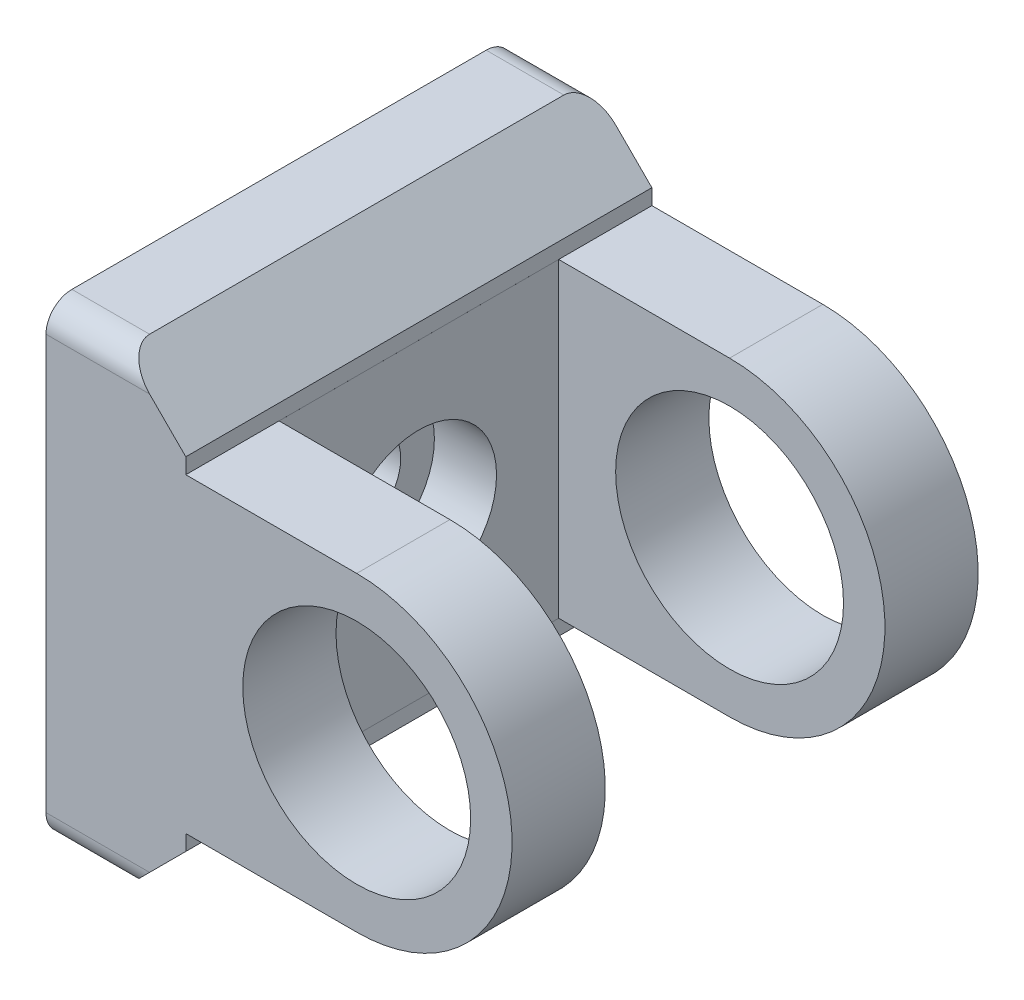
ISO-10303-21;
HEADER;
FILE_DESCRIPTION(('STEP AP214'),'2;1');
FILE_NAME('part.step','',(''),(''),'','','');
FILE_SCHEMA(('AUTOMOTIVE_DESIGN { 1 0 10303 214 1 1 1 1 }'));
ENDSEC;
DATA;
#1=APPLICATION_CONTEXT('core data for automotive mechanical design processes');
#2=APPLICATION_PROTOCOL_DEFINITION('international standard','automotive_design',2000,#1);
#3=PRODUCT_CONTEXT('',#1,'mechanical');
#4=PRODUCT('Part','Part','',(#3));
#5=PRODUCT_RELATED_PRODUCT_CATEGORY('part','',(#4));
#6=PRODUCT_DEFINITION_FORMATION('','',#4);
#7=PRODUCT_DEFINITION_CONTEXT('part definition',#1,'design');
#8=PRODUCT_DEFINITION('design','',#6,#7);
#9=PRODUCT_DEFINITION_SHAPE('','',#8);
#10=(LENGTH_UNIT() NAMED_UNIT(*) SI_UNIT(.MILLI.,.METRE.));
#11=(NAMED_UNIT(*) PLANE_ANGLE_UNIT() SI_UNIT($,.RADIAN.));
#12=(NAMED_UNIT(*) SI_UNIT($,.STERADIAN.) SOLID_ANGLE_UNIT());
#13=UNCERTAINTY_MEASURE_WITH_UNIT(LENGTH_MEASURE(1.E-05),#10,'distance_accuracy_value','');
#14=(GEOMETRIC_REPRESENTATION_CONTEXT(3) GLOBAL_UNCERTAINTY_ASSIGNED_CONTEXT((#13)) GLOBAL_UNIT_ASSIGNED_CONTEXT((#10,
#11,#12)) REPRESENTATION_CONTEXT('',''));
#15=CARTESIAN_POINT('',(0.,0.,0.));
#16=DIRECTION('',(0.,0.,1.));
#17=DIRECTION('',(1.,0.,0.));
#18=AXIS2_PLACEMENT_3D('',#15,#16,#17);
#19=CARTESIAN_POINT('',(-51.0000000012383,-1.59160878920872E-12,-40.0000000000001));
#20=DIRECTION('',(-1.,0.,0.));
#21=DIRECTION('',(0.,0.,1.));
#22=AXIS2_PLACEMENT_3D('',#19,#20,#21);
#23=CONICAL_SURFACE('',#22,2.06699999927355,1.02974425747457);
#24=CARTESIAN_POINT('',(-49.7580210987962,-5.6843418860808E-11,-40.0000000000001));
#25=VERTEX_POINT('',#24);
#26=VERTEX_LOOP('',#25);
#27=FACE_BOUND('',#26,.T.);
#28=CARTESIAN_POINT('',(-50.9999999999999,-1.591616E-12,-40.0000000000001));
#29=DIRECTION('',(1.,0.,0.));
#30=DIRECTION('',(0.,0.,-1.));
#31=AXIS2_PLACEMENT_3D('',#28,#29,#30);
#32=CIRCLE('',#31,2.067);
#33=CARTESIAN_POINT('',(-50.9999999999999,-1.591616E-12,-42.0670000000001));
#34=VERTEX_POINT('',#33);
#35=EDGE_CURVE('E154',#34,#34,#32,.F.);
#36=ORIENTED_EDGE('',*,*,#35,.T.);
#37=EDGE_LOOP('',(#36));
#38=FACE_BOUND('',#37,.T.);
#39=ADVANCED_FACE('F16',(#27,#38),#23,.F.);
#40=CARTESIAN_POINT('',(-51.0000000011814,-17.5000000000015,-22.5000000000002));
#41=DIRECTION('',(-1.,0.,0.));
#42=DIRECTION('',(0.,0.,1.));
#43=AXIS2_PLACEMENT_3D('',#40,#41,#42);
#44=CONICAL_SURFACE('',#43,2.06699999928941,1.02974425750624);
#45=CARTESIAN_POINT('',(-49.7580210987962,-17.4999999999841,-22.5000000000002));
#46=VERTEX_POINT('',#45);
#47=VERTEX_LOOP('',#46);
#48=FACE_BOUND('',#47,.T.);
#49=CARTESIAN_POINT('',(-51.,-17.5000000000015,-22.5000000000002));
#50=DIRECTION('',(1.,0.,0.));
#51=DIRECTION('',(0.,0.,-1.));
#52=AXIS2_PLACEMENT_3D('',#49,#50,#51);
#53=CIRCLE('',#52,2.067);
#54=CARTESIAN_POINT('',(-51.,-17.5000000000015,-24.5670000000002));
#55=VERTEX_POINT('',#54);
#56=EDGE_CURVE('E156',#55,#55,#53,.F.);
#57=ORIENTED_EDGE('',*,*,#56,.T.);
#58=EDGE_LOOP('',(#57));
#59=FACE_BOUND('',#58,.T.);
#60=ADVANCED_FACE('F151',(#48,#59),#44,.F.);
#61=CARTESIAN_POINT('',(-51.0000000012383,-1.64842098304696E-12,-5.00000000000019));
#62=DIRECTION('',(-1.,0.,0.));
#63=DIRECTION('',(0.,0.,1.));
#64=AXIS2_PLACEMENT_3D('',#61,#62,#63);
#65=CONICAL_SURFACE('',#64,2.06699999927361,1.02974425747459);
#66=CARTESIAN_POINT('',(-49.7580210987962,-5.6843418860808E-11,-5.00000000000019));
#67=VERTEX_POINT('',#66);
#68=VERTEX_LOOP('',#67);
#69=FACE_BOUND('',#68,.T.);
#70=CARTESIAN_POINT('',(-51.0000000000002,-1.648459E-12,-5.00000000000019));
#71=DIRECTION('',(1.,0.,0.));
#72=DIRECTION('',(0.,0.,-1.));
#73=AXIS2_PLACEMENT_3D('',#70,#71,#72);
#74=CIRCLE('',#73,2.067);
#75=CARTESIAN_POINT('',(-51.0000000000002,-1.648459E-12,-7.06700000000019));
#76=VERTEX_POINT('',#75);
#77=EDGE_CURVE('E159',#76,#76,#74,.F.);
#78=ORIENTED_EDGE('',*,*,#77,.T.);
#79=EDGE_LOOP('',(#78));
#80=FACE_BOUND('',#79,.T.);
#81=ADVANCED_FACE('F1061',(#69,#80),#65,.F.);
#82=CARTESIAN_POINT('',(-51.0000000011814,17.4999999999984,-22.5000000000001));
#83=DIRECTION('',(-1.,0.,0.));
#84=DIRECTION('',(0.,0.,1.));
#85=AXIS2_PLACEMENT_3D('',#82,#83,#84);
#86=CONICAL_SURFACE('',#85,2.06699999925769,1.0297442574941);
#87=CARTESIAN_POINT('',(-49.7580210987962,17.5000000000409,-22.5000000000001));
#88=VERTEX_POINT('',#87);
#89=VERTEX_LOOP('',#88);
#90=FACE_BOUND('',#89,.T.);
#91=CARTESIAN_POINT('',(-51.0000000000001,17.4999999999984,-22.5000000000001));
#92=DIRECTION('',(1.,0.,0.));
#93=DIRECTION('',(0.,0.,-1.));
#94=AXIS2_PLACEMENT_3D('',#91,#92,#93);
#95=CIRCLE('',#94,2.067);
#96=CARTESIAN_POINT('',(-51.0000000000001,17.4999999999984,-24.5670000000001));
#97=VERTEX_POINT('',#96);
#98=EDGE_CURVE('E273',#97,#97,#95,.F.);
#99=ORIENTED_EDGE('',*,*,#98,.T.);
#100=EDGE_LOOP('',(#99));
#101=FACE_BOUND('',#100,.T.);
#102=ADVANCED_FACE('F1058',(#90,#101),#86,.F.);
#103=CARTESIAN_POINT('',(-55.9999999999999,-1.591616E-12,-40.0000000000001));
#104=DIRECTION('',(1.,0.,0.));
#105=DIRECTION('',(0.,0.,-1.));
#106=AXIS2_PLACEMENT_3D('',#103,#104,#105);
#107=CYLINDRICAL_SURFACE('',#106,2.067);
#108=CARTESIAN_POINT('',(-51.9999999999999,-1.591616E-12,-40.0000000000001));
#109=DIRECTION('',(1.,0.,0.));
#110=DIRECTION('',(0.,0.,-1.));
#111=AXIS2_PLACEMENT_3D('',#108,#109,#110);
#112=CIRCLE('',#111,2.067);
#113=CARTESIAN_POINT('',(-51.9999999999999,-1.591616E-12,-42.0670000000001));
#114=VERTEX_POINT('',#113);
#115=EDGE_CURVE('E19',#114,#114,#112,.F.);
#116=ORIENTED_EDGE('',*,*,#115,.T.);
#117=EDGE_LOOP('',(#116));
#118=FACE_BOUND('',#117,.T.);
#119=ORIENTED_EDGE('',*,*,#35,.F.);
#120=EDGE_LOOP('',(#119));
#121=FACE_BOUND('',#120,.T.);
#122=ADVANCED_FACE('F1055',(#118,#121),#107,.F.);
#123=CARTESIAN_POINT('',(-56.,-17.5000000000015,-22.5000000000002));
#124=DIRECTION('',(1.,0.,0.));
#125=DIRECTION('',(0.,0.,-1.));
#126=AXIS2_PLACEMENT_3D('',#123,#124,#125);
#127=CYLINDRICAL_SURFACE('',#126,2.067);
#128=CARTESIAN_POINT('',(-52.,-17.5000000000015,-22.5000000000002));
#129=DIRECTION('',(1.,0.,0.));
#130=DIRECTION('',(0.,0.,-1.));
#131=AXIS2_PLACEMENT_3D('',#128,#129,#130);
#132=CIRCLE('',#131,2.067);
#133=CARTESIAN_POINT('',(-52.,-17.5000000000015,-24.5670000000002));
#134=VERTEX_POINT('',#133);
#135=EDGE_CURVE('E268',#134,#134,#132,.F.);
#136=ORIENTED_EDGE('',*,*,#135,.T.);
#137=EDGE_LOOP('',(#136));
#138=FACE_BOUND('',#137,.T.);
#139=ORIENTED_EDGE('',*,*,#56,.F.);
#140=EDGE_LOOP('',(#139));
#141=FACE_BOUND('',#140,.T.);
#142=ADVANCED_FACE('F1051',(#138,#141),#127,.F.);
#143=CARTESIAN_POINT('',(-56.0000000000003,-1.648459E-12,-5.00000000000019));
#144=DIRECTION('',(1.,0.,0.));
#145=DIRECTION('',(0.,0.,-1.));
#146=AXIS2_PLACEMENT_3D('',#143,#144,#145);
#147=CYLINDRICAL_SURFACE('',#146,2.067);
#148=CARTESIAN_POINT('',(-52.0000000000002,-1.648459E-12,-5.00000000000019));
#149=DIRECTION('',(1.,0.,0.));
#150=DIRECTION('',(0.,0.,-1.));
#151=AXIS2_PLACEMENT_3D('',#148,#149,#150);
#152=CIRCLE('',#151,2.067);
#153=CARTESIAN_POINT('',(-52.0000000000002,-1.648459E-12,-7.06700000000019));
#154=VERTEX_POINT('',#153);
#155=EDGE_CURVE('E266',#154,#154,#152,.F.);
#156=ORIENTED_EDGE('',*,*,#155,.T.);
#157=EDGE_LOOP('',(#156));
#158=FACE_BOUND('',#157,.T.);
#159=ORIENTED_EDGE('',*,*,#77,.F.);
#160=EDGE_LOOP('',(#159));
#161=FACE_BOUND('',#160,.T.);
#162=ADVANCED_FACE('F1044',(#158,#161),#147,.F.);
#163=CARTESIAN_POINT('',(-56.0000000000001,17.4999999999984,-22.5000000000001));
#164=DIRECTION('',(1.,0.,0.));
#165=DIRECTION('',(0.,0.,-1.));
#166=AXIS2_PLACEMENT_3D('',#163,#164,#165);
#167=CYLINDRICAL_SURFACE('',#166,2.067);
#168=CARTESIAN_POINT('',(-52.0000000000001,17.4999999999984,-22.5000000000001));
#169=DIRECTION('',(1.,0.,0.));
#170=DIRECTION('',(0.,0.,-1.));
#171=AXIS2_PLACEMENT_3D('',#168,#169,#170);
#172=CIRCLE('',#171,2.067);
#173=CARTESIAN_POINT('',(-52.0000000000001,17.4999999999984,-24.5670000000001));
#174=VERTEX_POINT('',#173);
#175=EDGE_CURVE('E263',#174,#174,#172,.F.);
#176=ORIENTED_EDGE('',*,*,#175,.T.);
#177=EDGE_LOOP('',(#176));
#178=FACE_BOUND('',#177,.T.);
#179=ORIENTED_EDGE('',*,*,#98,.F.);
#180=EDGE_LOOP('',(#179));
#181=FACE_BOUND('',#180,.T.);
#182=ADVANCED_FACE('F1034',(#178,#181),#167,.F.);
#183=CARTESIAN_POINT('',(-51.9999999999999,-1.591616E-12,-40.0000000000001));
#184=DIRECTION('',(1.,0.,0.));
#185=DIRECTION('',(0.,0.,-1.));
#186=AXIS2_PLACEMENT_3D('',#183,#184,#185);
#187=PLANE('',#186);
#188=ORIENTED_EDGE('',*,*,#115,.F.);
#189=EDGE_LOOP('',(#188));
#190=FACE_BOUND('',#189,.T.);
#191=CARTESIAN_POINT('',(-51.9999999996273,-1.59160878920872E-12,-40.0000000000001));
#192=DIRECTION('',(1.,0.,0.));
#193=DIRECTION('',(0.,0.,-1.));
#194=AXIS2_PLACEMENT_3D('',#191,#192,#193);
#195=CIRCLE('',#194,2.49999999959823);
#196=CARTESIAN_POINT('',(-51.9999999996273,-1.59160878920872E-12,-42.4999999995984));
#197=VERTEX_POINT('',#196);
#198=EDGE_CURVE('E260',#197,#197,#195,.F.);
#199=ORIENTED_EDGE('',*,*,#198,.T.);
#200=EDGE_LOOP('',(#199));
#201=FACE_BOUND('',#200,.T.);
#202=ADVANCED_FACE('F1031',(#190,#201),#187,.F.);
#203=CARTESIAN_POINT('',(-52.,-17.5000000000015,-22.5000000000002));
#204=DIRECTION('',(1.,0.,0.));
#205=DIRECTION('',(0.,0.,-1.));
#206=AXIS2_PLACEMENT_3D('',#203,#204,#205);
#207=PLANE('',#206);
#208=ORIENTED_EDGE('',*,*,#135,.F.);
#209=EDGE_LOOP('',(#208));
#210=FACE_BOUND('',#209,.T.);
#211=CARTESIAN_POINT('',(-51.9999999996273,-17.5000000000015,-22.5000000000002));
#212=DIRECTION('',(1.,0.,0.));
#213=DIRECTION('',(0.,0.,-1.));
#214=AXIS2_PLACEMENT_3D('',#211,#212,#213);
#215=CIRCLE('',#214,2.49999999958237);
#216=CARTESIAN_POINT('',(-51.9999999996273,-17.5000000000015,-24.9999999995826));
#217=VERTEX_POINT('',#216);
#218=EDGE_CURVE('E257',#217,#217,#215,.F.);
#219=ORIENTED_EDGE('',*,*,#218,.T.);
#220=EDGE_LOOP('',(#219));
#221=FACE_BOUND('',#220,.T.);
#222=ADVANCED_FACE('F1033',(#210,#221),#207,.F.);
#223=CARTESIAN_POINT('',(-52.0000000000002,-1.648459E-12,-5.00000000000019));
#224=DIRECTION('',(1.,0.,0.));
#225=DIRECTION('',(0.,0.,-1.));
#226=AXIS2_PLACEMENT_3D('',#223,#224,#225);
#227=PLANE('',#226);
#228=ORIENTED_EDGE('',*,*,#155,.F.);
#229=EDGE_LOOP('',(#228));
#230=FACE_BOUND('',#229,.T.);
#231=CARTESIAN_POINT('',(-51.9999999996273,-1.64842098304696E-12,-5.00000000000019));
#232=DIRECTION('',(1.,0.,0.));
#233=DIRECTION('',(0.,0.,-1.));
#234=AXIS2_PLACEMENT_3D('',#231,#232,#233);
#235=CIRCLE('',#234,2.49999999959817);
#236=CARTESIAN_POINT('',(-51.9999999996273,-1.64842098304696E-12,-7.49999999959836));
#237=VERTEX_POINT('',#236);
#238=EDGE_CURVE('E254',#237,#237,#235,.F.);
#239=ORIENTED_EDGE('',*,*,#238,.T.);
#240=EDGE_LOOP('',(#239));
#241=FACE_BOUND('',#240,.T.);
#242=ADVANCED_FACE('F1041',(#230,#241),#227,.F.);
#243=CARTESIAN_POINT('',(-52.0000000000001,17.4999999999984,-22.5000000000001));
#244=DIRECTION('',(1.,0.,0.));
#245=DIRECTION('',(0.,0.,-1.));
#246=AXIS2_PLACEMENT_3D('',#243,#244,#245);
#247=PLANE('',#246);
#248=ORIENTED_EDGE('',*,*,#175,.F.);
#249=EDGE_LOOP('',(#248));
#250=FACE_BOUND('',#249,.T.);
#251=CARTESIAN_POINT('',(-51.999999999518,17.4999999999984,-22.5000000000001));
#252=DIRECTION('',(1.,0.,0.));
#253=DIRECTION('',(0.,0.,-1.));
#254=AXIS2_PLACEMENT_3D('',#251,#252,#253);
#255=CIRCLE('',#254,2.49999999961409);
#256=CARTESIAN_POINT('',(-51.999999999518,17.4999999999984,-24.9999999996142));
#257=VERTEX_POINT('',#256);
#258=EDGE_CURVE('E250',#257,#257,#255,.F.);
#259=ORIENTED_EDGE('',*,*,#258,.T.);
#260=EDGE_LOOP('',(#259));
#261=FACE_BOUND('',#260,.T.);
#262=ADVANCED_FACE('F1027',(#250,#261),#247,.F.);
#263=CARTESIAN_POINT('',(-51.9999999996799,-1.59160878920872E-12,-40.0000000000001));
#264=DIRECTION('',(1.,0.,0.));
#265=DIRECTION('',(0.,0.,-1.));
#266=AXIS2_PLACEMENT_3D('',#263,#264,#265);
#267=CONICAL_SURFACE('',#266,2.49999999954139,0.824993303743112);
#268=CARTESIAN_POINT('',(-52.3999999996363,-1.591616E-12,-40.0000000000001));
#269=DIRECTION('',(-1.,0.,0.));
#270=DIRECTION('',(0.,-1.,0.));
#271=AXIS2_PLACEMENT_3D('',#268,#269,#270);
#272=CIRCLE('',#271,2.06700000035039);
#273=CARTESIAN_POINT('',(-52.3999999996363,-2.06700000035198,-40.0000000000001));
#274=VERTEX_POINT('',#273);
#275=EDGE_CURVE('E253',#274,#274,#272,.T.);
#276=ORIENTED_EDGE('',*,*,#275,.T.);
#277=EDGE_LOOP('',(#276));
#278=FACE_BOUND('',#277,.T.);
#279=ORIENTED_EDGE('',*,*,#198,.F.);
#280=EDGE_LOOP('',(#279));
#281=FACE_BOUND('',#280,.T.);
#282=ADVANCED_FACE('F1023',(#278,#281),#267,.F.);
#283=CARTESIAN_POINT('',(-51.9999999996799,-17.5000000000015,-22.5000000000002));
#284=DIRECTION('',(1.,0.,0.));
#285=DIRECTION('',(0.,0.,-1.));
#286=AXIS2_PLACEMENT_3D('',#283,#284,#285);
#287=CONICAL_SURFACE('',#286,2.49999999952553,0.824993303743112);
#288=CARTESIAN_POINT('',(-52.3999999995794,-17.5000000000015,-22.5000000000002));
#289=DIRECTION('',(-1.,0.,0.));
#290=DIRECTION('',(0.,-1.,0.));
#291=AXIS2_PLACEMENT_3D('',#288,#289,#290);
#292=CIRCLE('',#291,2.06700000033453);
#293=CARTESIAN_POINT('',(-52.3999999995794,-19.5670000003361,-22.5000000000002));
#294=VERTEX_POINT('',#293);
#295=EDGE_CURVE('E291',#294,#294,#292,.T.);
#296=ORIENTED_EDGE('',*,*,#295,.T.);
#297=EDGE_LOOP('',(#296));
#298=FACE_BOUND('',#297,.T.);
#299=ORIENTED_EDGE('',*,*,#218,.F.);
#300=EDGE_LOOP('',(#299));
#301=FACE_BOUND('',#300,.T.);
#302=ADVANCED_FACE('F1026',(#298,#301),#287,.F.);
#303=CARTESIAN_POINT('',(-51.9999999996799,-1.64842098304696E-12,-5.00000000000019));
#304=DIRECTION('',(1.,0.,0.));
#305=DIRECTION('',(0.,0.,-1.));
#306=AXIS2_PLACEMENT_3D('',#303,#304,#305);
#307=CONICAL_SURFACE('',#306,2.49999999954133,0.824993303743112);
#308=CARTESIAN_POINT('',(-52.3999999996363,-1.648459E-12,-5.00000000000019));
#309=DIRECTION('',(-1.,0.,0.));
#310=DIRECTION('',(0.,-1.,0.));
#311=AXIS2_PLACEMENT_3D('',#308,#309,#310);
#312=CIRCLE('',#311,2.06700000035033);
#313=CARTESIAN_POINT('',(-52.3999999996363,-2.06700000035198,-5.00000000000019));
#314=VERTEX_POINT('',#313);
#315=EDGE_CURVE('E296',#314,#314,#312,.T.);
#316=ORIENTED_EDGE('',*,*,#315,.T.);
#317=EDGE_LOOP('',(#316));
#318=FACE_BOUND('',#317,.T.);
#319=ORIENTED_EDGE('',*,*,#238,.F.);
#320=EDGE_LOOP('',(#319));
#321=FACE_BOUND('',#320,.T.);
#322=ADVANCED_FACE('F1147',(#318,#321),#307,.F.);
#323=CARTESIAN_POINT('',(-51.999999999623,17.4999999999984,-22.5000000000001));
#324=DIRECTION('',(1.,0.,0.));
#325=DIRECTION('',(0.,0.,-1.));
#326=AXIS2_PLACEMENT_3D('',#323,#324,#325);
#327=CONICAL_SURFACE('',#326,2.4999999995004,0.824993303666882);
#328=CARTESIAN_POINT('',(-52.3999999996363,17.4999999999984,-22.5000000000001));
#329=DIRECTION('',(-1.,0.,0.));
#330=DIRECTION('',(0.,-1.,0.));
#331=AXIS2_PLACEMENT_3D('',#328,#329,#330);
#332=CIRCLE('',#331,2.06700000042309);
#333=CARTESIAN_POINT('',(-52.3999999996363,15.4329999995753,-22.5000000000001));
#334=VERTEX_POINT('',#333);
#335=EDGE_CURVE('E301',#334,#334,#332,.T.);
#336=ORIENTED_EDGE('',*,*,#335,.T.);
#337=EDGE_LOOP('',(#336));
#338=FACE_BOUND('',#337,.T.);
#339=ORIENTED_EDGE('',*,*,#258,.F.);
#340=EDGE_LOOP('',(#339));
#341=FACE_BOUND('',#340,.T.);
#342=ADVANCED_FACE('F1019',(#338,#341),#327,.F.);
#343=CARTESIAN_POINT('',(-52.7999999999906,-1.59160878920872E-12,-40.0000000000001));
#344=DIRECTION('',(-1.,0.,0.));
#345=DIRECTION('',(0.,0.,1.));
#346=AXIS2_PLACEMENT_3D('',#343,#344,#345);
#347=CONICAL_SURFACE('',#346,2.49999999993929,0.824993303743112);
#348=CARTESIAN_POINT('',(-52.7999999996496,-1.591616E-12,-40.0000000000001));
#349=DIRECTION('',(1.,0.,0.));
#350=DIRECTION('',(0.,-1.,0.));
#351=AXIS2_PLACEMENT_3D('',#348,#349,#350);
#352=CIRCLE('',#351,2.49999999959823);
#353=CARTESIAN_POINT('',(-52.7999999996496,-2.49999999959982,-40.0000000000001));
#354=VERTEX_POINT('',#353);
#355=EDGE_CURVE('E306',#354,#354,#352,.F.);
#356=ORIENTED_EDGE('',*,*,#355,.T.);
#357=EDGE_LOOP('',(#356));
#358=FACE_BOUND('',#357,.T.);
#359=ORIENTED_EDGE('',*,*,#275,.F.);
#360=EDGE_LOOP('',(#359));
#361=FACE_BOUND('',#360,.T.);
#362=ADVANCED_FACE('F1015',(#358,#361),#347,.F.);
#363=CARTESIAN_POINT('',(-52.7999999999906,-17.5000000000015,-22.5000000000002));
#364=DIRECTION('',(-1.,0.,0.));
#365=DIRECTION('',(0.,0.,1.));
#366=AXIS2_PLACEMENT_3D('',#363,#364,#365);
#367=CONICAL_SURFACE('',#366,2.49999999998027,0.824993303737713);
#368=CARTESIAN_POINT('',(-52.7999999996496,-17.5000000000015,-22.5000000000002));
#369=DIRECTION('',(1.,0.,0.));
#370=DIRECTION('',(0.,-1.,0.));
#371=AXIS2_PLACEMENT_3D('',#368,#369,#370);
#372=CIRCLE('',#371,2.49999999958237);
#373=CARTESIAN_POINT('',(-52.7999999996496,-19.9999999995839,-22.5000000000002));
#374=VERTEX_POINT('',#373);
#375=EDGE_CURVE('E311',#374,#374,#372,.F.);
#376=ORIENTED_EDGE('',*,*,#375,.T.);
#377=EDGE_LOOP('',(#376));
#378=FACE_BOUND('',#377,.T.);
#379=ORIENTED_EDGE('',*,*,#295,.F.);
#380=EDGE_LOOP('',(#379));
#381=FACE_BOUND('',#380,.T.);
#382=ADVANCED_FACE('F1018',(#378,#381),#367,.F.);
#383=CARTESIAN_POINT('',(-52.7999999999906,-1.64842098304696E-12,-5.00000000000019));
#384=DIRECTION('',(-1.,0.,0.));
#385=DIRECTION('',(0.,0.,1.));
#386=AXIS2_PLACEMENT_3D('',#383,#384,#385);
#387=CONICAL_SURFACE('',#386,2.49999999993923,0.824993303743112);
#388=CARTESIAN_POINT('',(-52.7999999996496,-1.648459E-12,-5.00000000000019));
#389=DIRECTION('',(1.,0.,0.));
#390=DIRECTION('',(0.,-1.,0.));
#391=AXIS2_PLACEMENT_3D('',#388,#389,#390);
#392=CIRCLE('',#391,2.49999999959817);
#393=CARTESIAN_POINT('',(-52.7999999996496,-2.49999999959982,-5.00000000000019));
#394=VERTEX_POINT('',#393);
#395=EDGE_CURVE('E316',#394,#394,#392,.F.);
#396=ORIENTED_EDGE('',*,*,#395,.T.);
#397=EDGE_LOOP('',(#396));
#398=FACE_BOUND('',#397,.T.);
#399=ORIENTED_EDGE('',*,*,#315,.F.);
#400=EDGE_LOOP('',(#399));
#401=FACE_BOUND('',#400,.T.);
#402=ADVANCED_FACE('F1180',(#398,#401),#387,.F.);
#403=CARTESIAN_POINT('',(-52.7999999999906,17.4999999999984,-22.5000000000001));
#404=DIRECTION('',(-1.,0.,0.));
#405=DIRECTION('',(0.,0.,1.));
#406=AXIS2_PLACEMENT_3D('',#403,#404,#405);
#407=CONICAL_SURFACE('',#406,2.50000000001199,0.824993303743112);
#408=CARTESIAN_POINT('',(-52.7999999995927,17.4999999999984,-22.5000000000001));
#409=DIRECTION('',(1.,0.,0.));
#410=DIRECTION('',(0.,-1.,0.));
#411=AXIS2_PLACEMENT_3D('',#408,#409,#410);
#412=CIRCLE('',#411,2.49999999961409);
#413=CARTESIAN_POINT('',(-52.7999999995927,15.0000000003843,-22.5000000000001));
#414=VERTEX_POINT('',#413);
#415=EDGE_CURVE('E321',#414,#414,#412,.F.);
#416=ORIENTED_EDGE('',*,*,#415,.T.);
#417=EDGE_LOOP('',(#416));
#418=FACE_BOUND('',#417,.T.);
#419=ORIENTED_EDGE('',*,*,#335,.F.);
#420=EDGE_LOOP('',(#419));
#421=FACE_BOUND('',#420,.T.);
#422=ADVANCED_FACE('F1011',(#418,#421),#407,.F.);
#423=CARTESIAN_POINT('',(-52.7999999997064,-1.59160878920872E-12,-40.0000000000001));
#424=DIRECTION('',(1.,0.,0.));
#425=DIRECTION('',(0.,0.,-1.));
#426=AXIS2_PLACEMENT_3D('',#423,#424,#425);
#427=CONICAL_SURFACE('',#426,2.49999999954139,0.824993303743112);
#428=CARTESIAN_POINT('',(-53.1999999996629,-1.591616E-12,-40.0000000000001));
#429=DIRECTION('',(-1.,0.,0.));
#430=DIRECTION('',(0.,-1.,0.));
#431=AXIS2_PLACEMENT_3D('',#428,#429,#430);
#432=CIRCLE('',#431,2.06700000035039);
#433=CARTESIAN_POINT('',(-53.1999999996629,-2.06700000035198,-40.0000000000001));
#434=VERTEX_POINT('',#433);
#435=EDGE_CURVE('E326',#434,#434,#432,.T.);
#436=ORIENTED_EDGE('',*,*,#435,.T.);
#437=EDGE_LOOP('',(#436));
#438=FACE_BOUND('',#437,.T.);
#439=ORIENTED_EDGE('',*,*,#355,.F.);
#440=EDGE_LOOP('',(#439));
#441=FACE_BOUND('',#440,.T.);
#442=ADVANCED_FACE('F1007',(#438,#441),#427,.F.);
#443=CARTESIAN_POINT('',(-52.7999999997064,-17.5000000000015,-22.5000000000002));
#444=DIRECTION('',(1.,0.,0.));
#445=DIRECTION('',(0.,0.,-1.));
#446=AXIS2_PLACEMENT_3D('',#443,#444,#445);
#447=CONICAL_SURFACE('',#446,2.49999999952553,0.824993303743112);
#448=CARTESIAN_POINT('',(-53.199999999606,-17.5000000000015,-22.5000000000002));
#449=DIRECTION('',(-1.,0.,0.));
#450=DIRECTION('',(0.,-1.,0.));
#451=AXIS2_PLACEMENT_3D('',#448,#449,#450);
#452=CIRCLE('',#451,2.06700000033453);
#453=CARTESIAN_POINT('',(-53.199999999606,-19.5670000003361,-22.5000000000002));
#454=VERTEX_POINT('',#453);
#455=EDGE_CURVE('E331',#454,#454,#452,.T.);
#456=ORIENTED_EDGE('',*,*,#455,.T.);
#457=EDGE_LOOP('',(#456));
#458=FACE_BOUND('',#457,.T.);
#459=ORIENTED_EDGE('',*,*,#375,.F.);
#460=EDGE_LOOP('',(#459));
#461=FACE_BOUND('',#460,.T.);
#462=ADVANCED_FACE('F1010',(#458,#461),#447,.F.);
#463=CARTESIAN_POINT('',(-52.7999999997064,-1.64842098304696E-12,-5.00000000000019));
#464=DIRECTION('',(1.,0.,0.));
#465=DIRECTION('',(0.,0.,-1.));
#466=AXIS2_PLACEMENT_3D('',#463,#464,#465);
#467=CONICAL_SURFACE('',#466,2.49999999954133,0.824993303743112);
#468=CARTESIAN_POINT('',(-53.1999999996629,-1.648459E-12,-5.00000000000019));
#469=DIRECTION('',(-1.,0.,0.));
#470=DIRECTION('',(0.,-1.,0.));
#471=AXIS2_PLACEMENT_3D('',#468,#469,#470);
#472=CIRCLE('',#471,2.06700000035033);
#473=CARTESIAN_POINT('',(-53.1999999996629,-2.06700000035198,-5.00000000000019));
#474=VERTEX_POINT('',#473);
#475=EDGE_CURVE('E336',#474,#474,#472,.T.);
#476=ORIENTED_EDGE('',*,*,#475,.T.);
#477=EDGE_LOOP('',(#476));
#478=FACE_BOUND('',#477,.T.);
#479=ORIENTED_EDGE('',*,*,#395,.F.);
#480=EDGE_LOOP('',(#479));
#481=FACE_BOUND('',#480,.T.);
#482=ADVANCED_FACE('F1215',(#478,#481),#467,.F.);
#483=CARTESIAN_POINT('',(-52.7999999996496,17.4999999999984,-22.5000000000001));
#484=DIRECTION('',(1.,0.,0.));
#485=DIRECTION('',(0.,0.,-1.));
#486=AXIS2_PLACEMENT_3D('',#483,#484,#485);
#487=CONICAL_SURFACE('',#486,2.4999999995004,0.824993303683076);
#488=CARTESIAN_POINT('',(-53.1999999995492,17.4999999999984,-22.5000000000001));
#489=DIRECTION('',(-1.,0.,0.));
#490=DIRECTION('',(0.,-1.,0.));
#491=AXIS2_PLACEMENT_3D('',#488,#489,#490);
#492=CIRCLE('',#491,2.0670000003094);
#493=CARTESIAN_POINT('',(-53.1999999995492,15.4329999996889,-22.5000000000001));
#494=VERTEX_POINT('',#493);
#495=EDGE_CURVE('E341',#494,#494,#492,.T.);
#496=ORIENTED_EDGE('',*,*,#495,.T.);
#497=EDGE_LOOP('',(#496));
#498=FACE_BOUND('',#497,.T.);
#499=ORIENTED_EDGE('',*,*,#415,.F.);
#500=EDGE_LOOP('',(#499));
#501=FACE_BOUND('',#500,.T.);
#502=ADVANCED_FACE('F1003',(#498,#501),#487,.F.);
#503=CARTESIAN_POINT('',(-53.6000000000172,-1.59160878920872E-12,-40.0000000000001));
#504=DIRECTION('',(-1.,0.,0.));
#505=DIRECTION('',(0.,0.,1.));
#506=AXIS2_PLACEMENT_3D('',#503,#504,#505);
#507=CONICAL_SURFACE('',#506,2.49999999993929,0.824993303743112);
#508=CARTESIAN_POINT('',(-53.5999999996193,-1.591616E-12,-40.0000000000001));
#509=DIRECTION('',(1.,0.,0.));
#510=DIRECTION('',(0.,-1.,0.));
#511=AXIS2_PLACEMENT_3D('',#508,#509,#510);
#512=CIRCLE('',#511,2.49999999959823);
#513=CARTESIAN_POINT('',(-53.5999999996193,-2.49999999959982,-40.0000000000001));
#514=VERTEX_POINT('',#513);
#515=EDGE_CURVE('E346',#514,#514,#512,.F.);
#516=ORIENTED_EDGE('',*,*,#515,.T.);
#517=EDGE_LOOP('',(#516));
#518=FACE_BOUND('',#517,.T.);
#519=ORIENTED_EDGE('',*,*,#435,.F.);
#520=EDGE_LOOP('',(#519));
#521=FACE_BOUND('',#520,.T.);
#522=ADVANCED_FACE('F999',(#518,#521),#507,.F.);
#523=CARTESIAN_POINT('',(-53.6000000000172,-17.5000000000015,-22.5000000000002));
#524=DIRECTION('',(-1.,0.,0.));
#525=DIRECTION('',(0.,0.,1.));
#526=AXIS2_PLACEMENT_3D('',#523,#524,#525);
#527=CONICAL_SURFACE('',#526,2.49999999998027,0.824993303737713);
#528=CARTESIAN_POINT('',(-53.5999999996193,-17.5000000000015,-22.5000000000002));
#529=DIRECTION('',(1.,0.,0.));
#530=DIRECTION('',(0.,-1.,0.));
#531=AXIS2_PLACEMENT_3D('',#528,#529,#530);
#532=CIRCLE('',#531,2.49999999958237);
#533=CARTESIAN_POINT('',(-53.5999999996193,-19.9999999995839,-22.5000000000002));
#534=VERTEX_POINT('',#533);
#535=EDGE_CURVE('E351',#534,#534,#532,.F.);
#536=ORIENTED_EDGE('',*,*,#535,.T.);
#537=EDGE_LOOP('',(#536));
#538=FACE_BOUND('',#537,.T.);
#539=ORIENTED_EDGE('',*,*,#455,.F.);
#540=EDGE_LOOP('',(#539));
#541=FACE_BOUND('',#540,.T.);
#542=ADVANCED_FACE('F1002',(#538,#541),#527,.F.);
#543=CARTESIAN_POINT('',(-53.6000000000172,-1.64842098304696E-12,-5.00000000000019));
#544=DIRECTION('',(-1.,0.,0.));
#545=DIRECTION('',(0.,0.,1.));
#546=AXIS2_PLACEMENT_3D('',#543,#544,#545);
#547=CONICAL_SURFACE('',#546,2.49999999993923,0.824993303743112);
#548=CARTESIAN_POINT('',(-53.5999999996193,-1.648459E-12,-5.00000000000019));
#549=DIRECTION('',(1.,0.,0.));
#550=DIRECTION('',(0.,-1.,0.));
#551=AXIS2_PLACEMENT_3D('',#548,#549,#550);
#552=CIRCLE('',#551,2.49999999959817);
#553=CARTESIAN_POINT('',(-53.5999999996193,-2.49999999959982,-5.00000000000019));
#554=VERTEX_POINT('',#553);
#555=EDGE_CURVE('E356',#554,#554,#552,.F.);
#556=ORIENTED_EDGE('',*,*,#555,.T.);
#557=EDGE_LOOP('',(#556));
#558=FACE_BOUND('',#557,.T.);
#559=ORIENTED_EDGE('',*,*,#475,.F.);
#560=EDGE_LOOP('',(#559));
#561=FACE_BOUND('',#560,.T.);
#562=ADVANCED_FACE('F1248',(#558,#561),#547,.F.);
#563=CARTESIAN_POINT('',(-53.6000000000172,17.4999999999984,-22.5000000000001));
#564=DIRECTION('',(-1.,0.,0.));
#565=DIRECTION('',(0.,0.,1.));
#566=AXIS2_PLACEMENT_3D('',#563,#564,#565);
#567=CONICAL_SURFACE('',#566,2.50000000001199,0.824993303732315);
#568=CARTESIAN_POINT('',(-53.5999999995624,17.4999999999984,-22.5000000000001));
#569=DIRECTION('',(1.,0.,0.));
#570=DIRECTION('',(0.,-1.,0.));
#571=AXIS2_PLACEMENT_3D('',#568,#569,#570);
#572=CIRCLE('',#571,2.49999999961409);
#573=CARTESIAN_POINT('',(-53.5999999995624,15.0000000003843,-22.5000000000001));
#574=VERTEX_POINT('',#573);
#575=EDGE_CURVE('E361',#574,#574,#572,.F.);
#576=ORIENTED_EDGE('',*,*,#575,.T.);
#577=EDGE_LOOP('',(#576));
#578=FACE_BOUND('',#577,.T.);
#579=ORIENTED_EDGE('',*,*,#495,.F.);
#580=EDGE_LOOP('',(#579));
#581=FACE_BOUND('',#580,.T.);
#582=ADVANCED_FACE('F995',(#578,#581),#567,.F.);
#583=CARTESIAN_POINT('',(-53.5999999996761,-1.59160878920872E-12,-40.0000000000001));
#584=DIRECTION('',(1.,0.,0.));
#585=DIRECTION('',(0.,0.,-1.));
#586=AXIS2_PLACEMENT_3D('',#583,#584,#585);
#587=CONICAL_SURFACE('',#586,2.49999999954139,0.824993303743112);
#588=CARTESIAN_POINT('',(-53.9999999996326,-1.591616E-12,-40.0000000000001));
#589=DIRECTION('',(-1.,0.,0.));
#590=DIRECTION('',(0.,-1.,0.));
#591=AXIS2_PLACEMENT_3D('',#588,#589,#590);
#592=CIRCLE('',#591,2.06700000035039);
#593=CARTESIAN_POINT('',(-53.9999999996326,-2.06700000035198,-40.0000000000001));
#594=VERTEX_POINT('',#593);
#595=EDGE_CURVE('E366',#594,#594,#592,.T.);
#596=ORIENTED_EDGE('',*,*,#595,.T.);
#597=EDGE_LOOP('',(#596));
#598=FACE_BOUND('',#597,.T.);
#599=ORIENTED_EDGE('',*,*,#515,.F.);
#600=EDGE_LOOP('',(#599));
#601=FACE_BOUND('',#600,.T.);
#602=ADVANCED_FACE('F991',(#598,#601),#587,.F.);
#603=CARTESIAN_POINT('',(-53.5999999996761,-17.5000000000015,-22.5000000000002));
#604=DIRECTION('',(1.,0.,0.));
#605=DIRECTION('',(0.,0.,-1.));
#606=AXIS2_PLACEMENT_3D('',#603,#604,#605);
#607=CONICAL_SURFACE('',#606,2.49999999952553,0.824993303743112);
#608=CARTESIAN_POINT('',(-53.9999999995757,-17.5000000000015,-22.5000000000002));
#609=DIRECTION('',(-1.,0.,0.));
#610=DIRECTION('',(0.,-1.,0.));
#611=AXIS2_PLACEMENT_3D('',#608,#609,#610);
#612=CIRCLE('',#611,2.06700000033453);
#613=CARTESIAN_POINT('',(-53.9999999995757,-19.5670000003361,-22.5000000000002));
#614=VERTEX_POINT('',#613);
#615=EDGE_CURVE('E371',#614,#614,#612,.T.);
#616=ORIENTED_EDGE('',*,*,#615,.T.);
#617=EDGE_LOOP('',(#616));
#618=FACE_BOUND('',#617,.T.);
#619=ORIENTED_EDGE('',*,*,#535,.F.);
#620=EDGE_LOOP('',(#619));
#621=FACE_BOUND('',#620,.T.);
#622=ADVANCED_FACE('F994',(#618,#621),#607,.F.);
#623=CARTESIAN_POINT('',(-53.5999999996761,-1.64842098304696E-12,-5.00000000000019));
#624=DIRECTION('',(1.,0.,0.));
#625=DIRECTION('',(0.,0.,-1.));
#626=AXIS2_PLACEMENT_3D('',#623,#624,#625);
#627=CONICAL_SURFACE('',#626,2.49999999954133,0.824993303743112);
#628=CARTESIAN_POINT('',(-53.9999999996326,-1.648459E-12,-5.00000000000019));
#629=DIRECTION('',(-1.,0.,0.));
#630=DIRECTION('',(0.,-1.,0.));
#631=AXIS2_PLACEMENT_3D('',#628,#629,#630);
#632=CIRCLE('',#631,2.06700000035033);
#633=CARTESIAN_POINT('',(-53.9999999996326,-2.06700000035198,-5.00000000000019));
#634=VERTEX_POINT('',#633);
#635=EDGE_CURVE('E376',#634,#634,#632,.T.);
#636=ORIENTED_EDGE('',*,*,#635,.T.);
#637=EDGE_LOOP('',(#636));
#638=FACE_BOUND('',#637,.T.);
#639=ORIENTED_EDGE('',*,*,#555,.F.);
#640=EDGE_LOOP('',(#639));
#641=FACE_BOUND('',#640,.T.);
#642=ADVANCED_FACE('F1283',(#638,#641),#627,.F.);
#643=CARTESIAN_POINT('',(-53.5999999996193,17.4999999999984,-22.5000000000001));
#644=DIRECTION('',(1.,0.,0.));
#645=DIRECTION('',(0.,0.,-1.));
#646=AXIS2_PLACEMENT_3D('',#643,#644,#645);
#647=CONICAL_SURFACE('',#646,2.4999999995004,0.824993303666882);
#648=CARTESIAN_POINT('',(-53.9999999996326,17.4999999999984,-22.5000000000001));
#649=DIRECTION('',(-1.,0.,0.));
#650=DIRECTION('',(0.,-1.,0.));
#651=AXIS2_PLACEMENT_3D('',#648,#649,#650);
#652=CIRCLE('',#651,2.06700000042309);
#653=CARTESIAN_POINT('',(-53.9999999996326,15.4329999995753,-22.5000000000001));
#654=VERTEX_POINT('',#653);
#655=EDGE_CURVE('E381',#654,#654,#652,.T.);
#656=ORIENTED_EDGE('',*,*,#655,.T.);
#657=EDGE_LOOP('',(#656));
#658=FACE_BOUND('',#657,.T.);
#659=ORIENTED_EDGE('',*,*,#575,.F.);
#660=EDGE_LOOP('',(#659));
#661=FACE_BOUND('',#660,.T.);
#662=ADVANCED_FACE('F987',(#658,#661),#647,.F.);
#663=CARTESIAN_POINT('',(-54.3999999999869,-1.59160878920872E-12,-40.0000000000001));
#664=DIRECTION('',(-1.,0.,0.));
#665=DIRECTION('',(0.,0.,1.));
#666=AXIS2_PLACEMENT_3D('',#663,#664,#665);
#667=CONICAL_SURFACE('',#666,2.49999999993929,0.824993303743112);
#668=CARTESIAN_POINT('',(-54.3999999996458,-1.591616E-12,-40.0000000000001));
#669=DIRECTION('',(1.,0.,0.));
#670=DIRECTION('',(0.,-1.,0.));
#671=AXIS2_PLACEMENT_3D('',#668,#669,#670);
#672=CIRCLE('',#671,2.49999999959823);
#673=CARTESIAN_POINT('',(-54.3999999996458,-2.49999999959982,-40.0000000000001));
#674=VERTEX_POINT('',#673);
#675=EDGE_CURVE('E386',#674,#674,#672,.F.);
#676=ORIENTED_EDGE('',*,*,#675,.T.);
#677=EDGE_LOOP('',(#676));
#678=FACE_BOUND('',#677,.T.);
#679=ORIENTED_EDGE('',*,*,#595,.F.);
#680=EDGE_LOOP('',(#679));
#681=FACE_BOUND('',#680,.T.);
#682=ADVANCED_FACE('F983',(#678,#681),#667,.F.);
#683=CARTESIAN_POINT('',(-54.3999999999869,-17.5000000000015,-22.5000000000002));
#684=DIRECTION('',(-1.,0.,0.));
#685=DIRECTION('',(0.,0.,1.));
#686=AXIS2_PLACEMENT_3D('',#683,#684,#685);
#687=CONICAL_SURFACE('',#686,2.49999999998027,0.824993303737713);
#688=CARTESIAN_POINT('',(-54.3999999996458,-17.5000000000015,-22.5000000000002));
#689=DIRECTION('',(1.,0.,0.));
#690=DIRECTION('',(0.,-1.,0.));
#691=AXIS2_PLACEMENT_3D('',#688,#689,#690);
#692=CIRCLE('',#691,2.49999999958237);
#693=CARTESIAN_POINT('',(-54.3999999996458,-19.9999999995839,-22.5000000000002));
#694=VERTEX_POINT('',#693);
#695=EDGE_CURVE('E391',#694,#694,#692,.F.);
#696=ORIENTED_EDGE('',*,*,#695,.T.);
#697=EDGE_LOOP('',(#696));
#698=FACE_BOUND('',#697,.T.);
#699=ORIENTED_EDGE('',*,*,#615,.F.);
#700=EDGE_LOOP('',(#699));
#701=FACE_BOUND('',#700,.T.);
#702=ADVANCED_FACE('F986',(#698,#701),#687,.F.);
#703=CARTESIAN_POINT('',(-54.3999999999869,-1.64842098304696E-12,-5.00000000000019));
#704=DIRECTION('',(-1.,0.,0.));
#705=DIRECTION('',(0.,0.,1.));
#706=AXIS2_PLACEMENT_3D('',#703,#704,#705);
#707=CONICAL_SURFACE('',#706,2.49999999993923,0.824993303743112);
#708=CARTESIAN_POINT('',(-54.3999999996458,-1.648459E-12,-5.00000000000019));
#709=DIRECTION('',(1.,0.,0.));
#710=DIRECTION('',(0.,-1.,0.));
#711=AXIS2_PLACEMENT_3D('',#708,#709,#710);
#712=CIRCLE('',#711,2.49999999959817);
#713=CARTESIAN_POINT('',(-54.3999999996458,-2.49999999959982,-5.00000000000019));
#714=VERTEX_POINT('',#713);
#715=EDGE_CURVE('E396',#714,#714,#712,.F.);
#716=ORIENTED_EDGE('',*,*,#715,.T.);
#717=EDGE_LOOP('',(#716));
#718=FACE_BOUND('',#717,.T.);
#719=ORIENTED_EDGE('',*,*,#635,.F.);
#720=EDGE_LOOP('',(#719));
#721=FACE_BOUND('',#720,.T.);
#722=ADVANCED_FACE('F1316',(#718,#721),#707,.F.);
#723=CARTESIAN_POINT('',(-54.3999999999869,17.4999999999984,-22.5000000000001));
#724=DIRECTION('',(-1.,0.,0.));
#725=DIRECTION('',(0.,0.,1.));
#726=AXIS2_PLACEMENT_3D('',#723,#724,#725);
#727=CONICAL_SURFACE('',#726,2.50000000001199,0.824993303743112);
#728=CARTESIAN_POINT('',(-54.399999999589,17.4999999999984,-22.5000000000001));
#729=DIRECTION('',(1.,0.,0.));
#730=DIRECTION('',(0.,-1.,0.));
#731=AXIS2_PLACEMENT_3D('',#728,#729,#730);
#732=CIRCLE('',#731,2.49999999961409);
#733=CARTESIAN_POINT('',(-54.399999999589,15.0000000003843,-22.5000000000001));
#734=VERTEX_POINT('',#733);
#735=EDGE_CURVE('E401',#734,#734,#732,.F.);
#736=ORIENTED_EDGE('',*,*,#735,.T.);
#737=EDGE_LOOP('',(#736));
#738=FACE_BOUND('',#737,.T.);
#739=ORIENTED_EDGE('',*,*,#655,.F.);
#740=EDGE_LOOP('',(#739));
#741=FACE_BOUND('',#740,.T.);
#742=ADVANCED_FACE('F979',(#738,#741),#727,.F.);
#743=CARTESIAN_POINT('',(-54.3999999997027,-1.59160878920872E-12,-40.0000000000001));
#744=DIRECTION('',(1.,0.,0.));
#745=DIRECTION('',(0.,0.,-1.));
#746=AXIS2_PLACEMENT_3D('',#743,#744,#745);
#747=CONICAL_SURFACE('',#746,2.49999999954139,0.824993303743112);
#748=CARTESIAN_POINT('',(-54.7999999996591,-1.591616E-12,-40.0000000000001));
#749=DIRECTION('',(-1.,0.,0.));
#750=DIRECTION('',(0.,-1.,0.));
#751=AXIS2_PLACEMENT_3D('',#748,#749,#750);
#752=CIRCLE('',#751,2.06700000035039);
#753=CARTESIAN_POINT('',(-54.7999999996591,-2.06700000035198,-40.0000000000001));
#754=VERTEX_POINT('',#753);
#755=EDGE_CURVE('E406',#754,#754,#752,.T.);
#756=ORIENTED_EDGE('',*,*,#755,.T.);
#757=EDGE_LOOP('',(#756));
#758=FACE_BOUND('',#757,.T.);
#759=ORIENTED_EDGE('',*,*,#675,.F.);
#760=EDGE_LOOP('',(#759));
#761=FACE_BOUND('',#760,.T.);
#762=ADVANCED_FACE('F975',(#758,#761),#747,.F.);
#763=CARTESIAN_POINT('',(-54.3999999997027,-17.5000000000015,-22.5000000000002));
#764=DIRECTION('',(1.,0.,0.));
#765=DIRECTION('',(0.,0.,-1.));
#766=AXIS2_PLACEMENT_3D('',#763,#764,#765);
#767=CONICAL_SURFACE('',#766,2.49999999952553,0.824993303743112);
#768=CARTESIAN_POINT('',(-54.7999999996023,-17.5000000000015,-22.5000000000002));
#769=DIRECTION('',(-1.,0.,0.));
#770=DIRECTION('',(0.,-1.,0.));
#771=AXIS2_PLACEMENT_3D('',#768,#769,#770);
#772=CIRCLE('',#771,2.06700000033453);
#773=CARTESIAN_POINT('',(-54.7999999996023,-19.5670000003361,-22.5000000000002));
#774=VERTEX_POINT('',#773);
#775=EDGE_CURVE('E411',#774,#774,#772,.T.);
#776=ORIENTED_EDGE('',*,*,#775,.T.);
#777=EDGE_LOOP('',(#776));
#778=FACE_BOUND('',#777,.T.);
#779=ORIENTED_EDGE('',*,*,#695,.F.);
#780=EDGE_LOOP('',(#779));
#781=FACE_BOUND('',#780,.T.);
#782=ADVANCED_FACE('F978',(#778,#781),#767,.F.);
#783=CARTESIAN_POINT('',(-54.3999999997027,-1.64842098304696E-12,-5.00000000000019));
#784=DIRECTION('',(1.,0.,0.));
#785=DIRECTION('',(0.,0.,-1.));
#786=AXIS2_PLACEMENT_3D('',#783,#784,#785);
#787=CONICAL_SURFACE('',#786,2.49999999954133,0.824993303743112);
#788=CARTESIAN_POINT('',(-54.7999999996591,-1.648459E-12,-5.00000000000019));
#789=DIRECTION('',(-1.,0.,0.));
#790=DIRECTION('',(0.,-1.,0.));
#791=AXIS2_PLACEMENT_3D('',#788,#789,#790);
#792=CIRCLE('',#791,2.06700000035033);
#793=CARTESIAN_POINT('',(-54.7999999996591,-2.06700000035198,-5.00000000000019));
#794=VERTEX_POINT('',#793);
#795=EDGE_CURVE('E416',#794,#794,#792,.T.);
#796=ORIENTED_EDGE('',*,*,#795,.T.);
#797=EDGE_LOOP('',(#796));
#798=FACE_BOUND('',#797,.T.);
#799=ORIENTED_EDGE('',*,*,#715,.F.);
#800=EDGE_LOOP('',(#799));
#801=FACE_BOUND('',#800,.T.);
#802=ADVANCED_FACE('F1351',(#798,#801),#787,.F.);
#803=CARTESIAN_POINT('',(-54.3999999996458,17.4999999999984,-22.5000000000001));
#804=DIRECTION('',(1.,0.,0.));
#805=DIRECTION('',(0.,0.,-1.));
#806=AXIS2_PLACEMENT_3D('',#803,#804,#805);
#807=CONICAL_SURFACE('',#806,2.4999999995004,0.824993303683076);
#808=CARTESIAN_POINT('',(-54.7999999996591,17.4999999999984,-22.5000000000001));
#809=DIRECTION('',(-1.,0.,0.));
#810=DIRECTION('',(0.,-1.,0.));
#811=AXIS2_PLACEMENT_3D('',#808,#809,#810);
#812=CIRCLE('',#811,2.06700000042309);
#813=CARTESIAN_POINT('',(-54.7999999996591,15.4329999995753,-22.5000000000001));
#814=VERTEX_POINT('',#813);
#815=EDGE_CURVE('E421',#814,#814,#812,.T.);
#816=ORIENTED_EDGE('',*,*,#815,.T.);
#817=EDGE_LOOP('',(#816));
#818=FACE_BOUND('',#817,.T.);
#819=ORIENTED_EDGE('',*,*,#735,.F.);
#820=EDGE_LOOP('',(#819));
#821=FACE_BOUND('',#820,.T.);
#822=ADVANCED_FACE('F971',(#818,#821),#807,.F.);
#823=CARTESIAN_POINT('',(-55.2000000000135,-1.59160878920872E-12,-40.0000000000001));
#824=DIRECTION('',(-1.,0.,0.));
#825=DIRECTION('',(0.,0.,1.));
#826=AXIS2_PLACEMENT_3D('',#823,#824,#825);
#827=CONICAL_SURFACE('',#826,2.49999999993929,0.824993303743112);
#828=CARTESIAN_POINT('',(-55.1999999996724,-1.534772E-12,-40.0000000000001));
#829=DIRECTION('',(1.,0.,0.));
#830=DIRECTION('',(0.,-1.,0.));
#831=AXIS2_PLACEMENT_3D('',#828,#829,#830);
#832=CIRCLE('',#831,2.49999999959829);
#833=CARTESIAN_POINT('',(-55.1999999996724,-2.49999999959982,-40.0000000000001));
#834=VERTEX_POINT('',#833);
#835=EDGE_CURVE('E426',#834,#834,#832,.F.);
#836=ORIENTED_EDGE('',*,*,#835,.T.);
#837=EDGE_LOOP('',(#836));
#838=FACE_BOUND('',#837,.T.);
#839=ORIENTED_EDGE('',*,*,#755,.F.);
#840=EDGE_LOOP('',(#839));
#841=FACE_BOUND('',#840,.T.);
#842=ADVANCED_FACE('F967',(#838,#841),#827,.F.);
#843=CARTESIAN_POINT('',(-55.2000000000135,-17.5000000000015,-22.5000000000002));
#844=DIRECTION('',(-1.,0.,0.));
#845=DIRECTION('',(0.,0.,1.));
#846=AXIS2_PLACEMENT_3D('',#843,#844,#845);
#847=CONICAL_SURFACE('',#846,2.49999999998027,0.824993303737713);
#848=CARTESIAN_POINT('',(-55.1999999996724,-17.5000000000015,-22.5000000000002));
#849=DIRECTION('',(1.,0.,0.));
#850=DIRECTION('',(0.,-1.,0.));
#851=AXIS2_PLACEMENT_3D('',#848,#849,#850);
#852=CIRCLE('',#851,2.49999999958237);
#853=CARTESIAN_POINT('',(-55.1999999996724,-19.9999999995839,-22.5000000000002));
#854=VERTEX_POINT('',#853);
#855=EDGE_CURVE('E431',#854,#854,#852,.F.);
#856=ORIENTED_EDGE('',*,*,#855,.T.);
#857=EDGE_LOOP('',(#856));
#858=FACE_BOUND('',#857,.T.);
#859=ORIENTED_EDGE('',*,*,#775,.F.);
#860=EDGE_LOOP('',(#859));
#861=FACE_BOUND('',#860,.T.);
#862=ADVANCED_FACE('F970',(#858,#861),#847,.F.);
#863=CARTESIAN_POINT('',(-55.2000000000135,-1.64842098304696E-12,-5.00000000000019));
#864=DIRECTION('',(-1.,0.,0.));
#865=DIRECTION('',(0.,0.,1.));
#866=AXIS2_PLACEMENT_3D('',#863,#864,#865);
#867=CONICAL_SURFACE('',#866,2.49999999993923,0.824993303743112);
#868=CARTESIAN_POINT('',(-55.1999999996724,-1.591616E-12,-5.00000000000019));
#869=DIRECTION('',(1.,0.,0.));
#870=DIRECTION('',(0.,-1.,0.));
#871=AXIS2_PLACEMENT_3D('',#868,#869,#870);
#872=CIRCLE('',#871,2.49999999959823);
#873=CARTESIAN_POINT('',(-55.1999999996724,-2.49999999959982,-5.00000000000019));
#874=VERTEX_POINT('',#873);
#875=EDGE_CURVE('E436',#874,#874,#872,.F.);
#876=ORIENTED_EDGE('',*,*,#875,.T.);
#877=EDGE_LOOP('',(#876));
#878=FACE_BOUND('',#877,.T.);
#879=ORIENTED_EDGE('',*,*,#795,.F.);
#880=EDGE_LOOP('',(#879));
#881=FACE_BOUND('',#880,.T.);
#882=ADVANCED_FACE('F1384',(#878,#881),#867,.F.);
#883=CARTESIAN_POINT('',(-55.2000000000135,17.4999999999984,-22.5000000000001));
#884=DIRECTION('',(-1.,0.,0.));
#885=DIRECTION('',(0.,0.,1.));
#886=AXIS2_PLACEMENT_3D('',#883,#884,#885);
#887=CONICAL_SURFACE('',#886,2.50000000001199,0.824993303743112);
#888=CARTESIAN_POINT('',(-55.1999999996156,17.4999999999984,-22.5000000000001));
#889=DIRECTION('',(1.,0.,0.));
#890=DIRECTION('',(0.,-1.,0.));
#891=AXIS2_PLACEMENT_3D('',#888,#889,#890);
#892=CIRCLE('',#891,2.49999999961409);
#893=CARTESIAN_POINT('',(-55.1999999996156,15.0000000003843,-22.5000000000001));
#894=VERTEX_POINT('',#893);
#895=EDGE_CURVE('E441',#894,#894,#892,.F.);
#896=ORIENTED_EDGE('',*,*,#895,.T.);
#897=EDGE_LOOP('',(#896));
#898=FACE_BOUND('',#897,.T.);
#899=ORIENTED_EDGE('',*,*,#815,.F.);
#900=EDGE_LOOP('',(#899));
#901=FACE_BOUND('',#900,.T.);
#902=ADVANCED_FACE('F963',(#898,#901),#887,.F.);
#903=CARTESIAN_POINT('',(-55.1999999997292,-1.53479659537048E-12,-40.0000000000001));
#904=DIRECTION('',(1.,0.,0.));
#905=DIRECTION('',(0.,0.,-1.));
#906=AXIS2_PLACEMENT_3D('',#903,#904,#905);
#907=CONICAL_SURFACE('',#906,2.49999999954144,0.824993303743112);
#908=CARTESIAN_POINT('',(-55.5999999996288,-1.534772E-12,-40.0000000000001));
#909=DIRECTION('',(-1.,0.,0.));
#910=DIRECTION('',(0.,-1.,0.));
#911=AXIS2_PLACEMENT_3D('',#908,#909,#910);
#912=CIRCLE('',#911,2.06700000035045);
#913=CARTESIAN_POINT('',(-55.5999999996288,-2.06700000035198,-40.0000000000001));
#914=VERTEX_POINT('',#913);
#915=EDGE_CURVE('E446',#914,#914,#912,.T.);
#916=ORIENTED_EDGE('',*,*,#915,.T.);
#917=EDGE_LOOP('',(#916));
#918=FACE_BOUND('',#917,.T.);
#919=ORIENTED_EDGE('',*,*,#835,.F.);
#920=EDGE_LOOP('',(#919));
#921=FACE_BOUND('',#920,.T.);
#922=ADVANCED_FACE('F959',(#918,#921),#907,.F.);
#923=CARTESIAN_POINT('',(-55.1999999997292,-17.5000000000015,-22.5000000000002));
#924=DIRECTION('',(1.,0.,0.));
#925=DIRECTION('',(0.,0.,-1.));
#926=AXIS2_PLACEMENT_3D('',#923,#924,#925);
#927=CONICAL_SURFACE('',#926,2.49999999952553,0.824993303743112);
#928=CARTESIAN_POINT('',(-55.599999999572,-17.5000000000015,-22.5000000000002));
#929=DIRECTION('',(-1.,0.,0.));
#930=DIRECTION('',(0.,-1.,0.));
#931=AXIS2_PLACEMENT_3D('',#928,#929,#930);
#932=CIRCLE('',#931,2.06700000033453);
#933=CARTESIAN_POINT('',(-55.599999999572,-19.5670000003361,-22.5000000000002));
#934=VERTEX_POINT('',#933);
#935=EDGE_CURVE('E451',#934,#934,#932,.T.);
#936=ORIENTED_EDGE('',*,*,#935,.T.);
#937=EDGE_LOOP('',(#936));
#938=FACE_BOUND('',#937,.T.);
#939=ORIENTED_EDGE('',*,*,#855,.F.);
#940=EDGE_LOOP('',(#939));
#941=FACE_BOUND('',#940,.T.);
#942=ADVANCED_FACE('F962',(#938,#941),#927,.F.);
#943=CARTESIAN_POINT('',(-55.1999999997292,-1.59160878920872E-12,-5.00000000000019));
#944=DIRECTION('',(1.,0.,0.));
#945=DIRECTION('',(0.,0.,-1.));
#946=AXIS2_PLACEMENT_3D('',#943,#944,#945);
#947=CONICAL_SURFACE('',#946,2.49999999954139,0.824993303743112);
#948=CARTESIAN_POINT('',(-55.5999999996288,-1.591616E-12,-5.00000000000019));
#949=DIRECTION('',(-1.,0.,0.));
#950=DIRECTION('',(0.,-1.,0.));
#951=AXIS2_PLACEMENT_3D('',#948,#949,#950);
#952=CIRCLE('',#951,2.06700000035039);
#953=CARTESIAN_POINT('',(-55.5999999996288,-2.06700000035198,-5.00000000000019));
#954=VERTEX_POINT('',#953);
#955=EDGE_CURVE('E456',#954,#954,#952,.T.);
#956=ORIENTED_EDGE('',*,*,#955,.T.);
#957=EDGE_LOOP('',(#956));
#958=FACE_BOUND('',#957,.T.);
#959=ORIENTED_EDGE('',*,*,#875,.F.);
#960=EDGE_LOOP('',(#959));
#961=FACE_BOUND('',#960,.T.);
#962=ADVANCED_FACE('F1419',(#958,#961),#947,.F.);
#963=CARTESIAN_POINT('',(-55.1999999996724,17.4999999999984,-22.5000000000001));
#964=DIRECTION('',(1.,0.,0.));
#965=DIRECTION('',(0.,0.,-1.));
#966=AXIS2_PLACEMENT_3D('',#963,#964,#965);
#967=CONICAL_SURFACE('',#966,2.4999999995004,0.824993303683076);
#968=CARTESIAN_POINT('',(-55.5999999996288,17.4999999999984,-22.5000000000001));
#969=DIRECTION('',(-1.,0.,0.));
#970=DIRECTION('',(0.,-1.,0.));
#971=AXIS2_PLACEMENT_3D('',#968,#969,#970);
#972=CIRCLE('',#971,2.06700000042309);
#973=CARTESIAN_POINT('',(-55.5999999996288,15.4329999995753,-22.5000000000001));
#974=VERTEX_POINT('',#973);
#975=EDGE_CURVE('E461',#974,#974,#972,.T.);
#976=ORIENTED_EDGE('',*,*,#975,.T.);
#977=EDGE_LOOP('',(#976));
#978=FACE_BOUND('',#977,.T.);
#979=ORIENTED_EDGE('',*,*,#895,.F.);
#980=EDGE_LOOP('',(#979));
#981=FACE_BOUND('',#980,.T.);
#982=ADVANCED_FACE('F955',(#978,#981),#967,.F.);
#983=CARTESIAN_POINT('',(-55.9999999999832,-1.53479659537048E-12,-40.0000000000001));
#984=DIRECTION('',(-1.,0.,0.));
#985=DIRECTION('',(0.,0.,1.));
#986=AXIS2_PLACEMENT_3D('',#983,#984,#985);
#987=CONICAL_SURFACE('',#986,2.49999999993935,0.824993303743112);
#988=CARTESIAN_POINT('',(-55.9999999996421,-1.534772E-12,-40.0000000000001));
#989=DIRECTION('',(1.,0.,0.));
#990=DIRECTION('',(0.,-1.,0.));
#991=AXIS2_PLACEMENT_3D('',#988,#989,#990);
#992=CIRCLE('',#991,2.49999999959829);
#993=CARTESIAN_POINT('',(-55.9999999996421,-2.49999999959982,-40.0000000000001));
#994=VERTEX_POINT('',#993);
#995=EDGE_CURVE('E466',#994,#994,#992,.F.);
#996=ORIENTED_EDGE('',*,*,#995,.T.);
#997=EDGE_LOOP('',(#996));
#998=FACE_BOUND('',#997,.T.);
#999=ORIENTED_EDGE('',*,*,#915,.F.);
#1000=EDGE_LOOP('',(#999));
#1001=FACE_BOUND('',#1000,.T.);
#1002=ADVANCED_FACE('F951',(#998,#1001),#987,.F.);
#1003=CARTESIAN_POINT('',(-55.9999999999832,-17.5000000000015,-22.5000000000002));
#1004=DIRECTION('',(-1.,0.,0.));
#1005=DIRECTION('',(0.,0.,1.));
#1006=AXIS2_PLACEMENT_3D('',#1003,#1004,#1005);
#1007=CONICAL_SURFACE('',#1006,2.49999999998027,0.824993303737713);
#1008=CARTESIAN_POINT('',(-55.9999999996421,-17.5000000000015,-22.5000000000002));
#1009=DIRECTION('',(1.,0.,0.));
#1010=DIRECTION('',(0.,-1.,0.));
#1011=AXIS2_PLACEMENT_3D('',#1008,#1009,#1010);
#1012=CIRCLE('',#1011,2.49999999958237);
#1013=CARTESIAN_POINT('',(-55.9999999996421,-19.9999999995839,-22.5000000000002));
#1014=VERTEX_POINT('',#1013);
#1015=EDGE_CURVE('E471',#1014,#1014,#1012,.F.);
#1016=ORIENTED_EDGE('',*,*,#1015,.T.);
#1017=EDGE_LOOP('',(#1016));
#1018=FACE_BOUND('',#1017,.T.);
#1019=ORIENTED_EDGE('',*,*,#935,.F.);
#1020=EDGE_LOOP('',(#1019));
#1021=FACE_BOUND('',#1020,.T.);
#1022=ADVANCED_FACE('F954',(#1018,#1021),#1007,.F.);
#1023=CARTESIAN_POINT('',(-55.9999999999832,-1.59160878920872E-12,-5.00000000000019));
#1024=DIRECTION('',(-1.,0.,0.));
#1025=DIRECTION('',(0.,0.,1.));
#1026=AXIS2_PLACEMENT_3D('',#1023,#1024,#1025);
#1027=CONICAL_SURFACE('',#1026,2.49999999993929,0.824993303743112);
#1028=CARTESIAN_POINT('',(-55.9999999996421,-1.591616E-12,-5.00000000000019));
#1029=DIRECTION('',(1.,0.,0.));
#1030=DIRECTION('',(0.,-1.,0.));
#1031=AXIS2_PLACEMENT_3D('',#1028,#1029,#1030);
#1032=CIRCLE('',#1031,2.49999999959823);
#1033=CARTESIAN_POINT('',(-55.9999999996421,-2.49999999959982,-5.00000000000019));
#1034=VERTEX_POINT('',#1033);
#1035=EDGE_CURVE('E476',#1034,#1034,#1032,.F.);
#1036=ORIENTED_EDGE('',*,*,#1035,.T.);
#1037=EDGE_LOOP('',(#1036));
#1038=FACE_BOUND('',#1037,.T.);
#1039=ORIENTED_EDGE('',*,*,#955,.F.);
#1040=EDGE_LOOP('',(#1039));
#1041=FACE_BOUND('',#1040,.T.);
#1042=ADVANCED_FACE('F1452',(#1038,#1041),#1027,.F.);
#1043=CARTESIAN_POINT('',(-55.9999999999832,17.4999999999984,-22.5000000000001));
#1044=DIRECTION('',(-1.,0.,0.));
#1045=DIRECTION('',(0.,0.,1.));
#1046=AXIS2_PLACEMENT_3D('',#1043,#1044,#1045);
#1047=CONICAL_SURFACE('',#1046,2.50000000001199,0.824993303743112);
#1048=CARTESIAN_POINT('',(-55.9999999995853,17.4999999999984,-22.5000000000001));
#1049=DIRECTION('',(1.,0.,0.));
#1050=DIRECTION('',(0.,-1.,0.));
#1051=AXIS2_PLACEMENT_3D('',#1048,#1049,#1050);
#1052=CIRCLE('',#1051,2.49999999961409);
#1053=CARTESIAN_POINT('',(-55.9999999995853,15.0000000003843,-22.5000000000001));
#1054=VERTEX_POINT('',#1053);
#1055=EDGE_CURVE('E481',#1054,#1054,#1052,.F.);
#1056=ORIENTED_EDGE('',*,*,#1055,.T.);
#1057=EDGE_LOOP('',(#1056));
#1058=FACE_BOUND('',#1057,.T.);
#1059=ORIENTED_EDGE('',*,*,#975,.F.);
#1060=EDGE_LOOP('',(#1059));
#1061=FACE_BOUND('',#1060,.T.);
#1062=ADVANCED_FACE('F947',(#1058,#1061),#1047,.F.);
#1063=CARTESIAN_POINT('',(-55.999999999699,-1.53479659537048E-12,-40.0000000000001));
#1064=DIRECTION('',(1.,0.,0.));
#1065=DIRECTION('',(0.,0.,-1.));
#1066=AXIS2_PLACEMENT_3D('',#1063,#1064,#1065);
#1067=CONICAL_SURFACE('',#1066,2.49999999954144,0.824993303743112);
#1068=CARTESIAN_POINT('',(-56.3999999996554,-1.534772E-12,-40.0000000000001));
#1069=DIRECTION('',(-1.,0.,0.));
#1070=DIRECTION('',(0.,-1.,0.));
#1071=AXIS2_PLACEMENT_3D('',#1068,#1069,#1070);
#1072=CIRCLE('',#1071,2.06700000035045);
#1073=CARTESIAN_POINT('',(-56.3999999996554,-2.06700000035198,-40.0000000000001));
#1074=VERTEX_POINT('',#1073);
#1075=EDGE_CURVE('E486',#1074,#1074,#1072,.T.);
#1076=ORIENTED_EDGE('',*,*,#1075,.T.);
#1077=EDGE_LOOP('',(#1076));
#1078=FACE_BOUND('',#1077,.T.);
#1079=ORIENTED_EDGE('',*,*,#995,.F.);
#1080=EDGE_LOOP('',(#1079));
#1081=FACE_BOUND('',#1080,.T.);
#1082=ADVANCED_FACE('F943',(#1078,#1081),#1067,.F.);
#1083=CARTESIAN_POINT('',(-55.999999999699,-17.5000000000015,-22.5000000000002));
#1084=DIRECTION('',(1.,0.,0.));
#1085=DIRECTION('',(0.,0.,-1.));
#1086=AXIS2_PLACEMENT_3D('',#1083,#1084,#1085);
#1087=CONICAL_SURFACE('',#1086,2.49999999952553,0.824993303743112);
#1088=CARTESIAN_POINT('',(-56.3999999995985,-17.5000000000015,-22.5000000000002));
#1089=DIRECTION('',(-1.,0.,0.));
#1090=DIRECTION('',(0.,-1.,0.));
#1091=AXIS2_PLACEMENT_3D('',#1088,#1089,#1090);
#1092=CIRCLE('',#1091,2.06700000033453);
#1093=CARTESIAN_POINT('',(-56.3999999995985,-19.5670000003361,-22.5000000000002));
#1094=VERTEX_POINT('',#1093);
#1095=EDGE_CURVE('E491',#1094,#1094,#1092,.T.);
#1096=ORIENTED_EDGE('',*,*,#1095,.T.);
#1097=EDGE_LOOP('',(#1096));
#1098=FACE_BOUND('',#1097,.T.);
#1099=ORIENTED_EDGE('',*,*,#1015,.F.);
#1100=EDGE_LOOP('',(#1099));
#1101=FACE_BOUND('',#1100,.T.);
#1102=ADVANCED_FACE('F946',(#1098,#1101),#1087,.F.);
#1103=CARTESIAN_POINT('',(-55.999999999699,-1.59160878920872E-12,-5.00000000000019));
#1104=DIRECTION('',(1.,0.,0.));
#1105=DIRECTION('',(0.,0.,-1.));
#1106=AXIS2_PLACEMENT_3D('',#1103,#1104,#1105);
#1107=CONICAL_SURFACE('',#1106,2.49999999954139,0.824993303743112);
#1108=CARTESIAN_POINT('',(-56.3999999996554,-1.591616E-12,-5.00000000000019));
#1109=DIRECTION('',(-1.,0.,0.));
#1110=DIRECTION('',(0.,-1.,0.));
#1111=AXIS2_PLACEMENT_3D('',#1108,#1109,#1110);
#1112=CIRCLE('',#1111,2.06700000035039);
#1113=CARTESIAN_POINT('',(-56.3999999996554,-2.06700000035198,-5.00000000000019));
#1114=VERTEX_POINT('',#1113);
#1115=EDGE_CURVE('E496',#1114,#1114,#1112,.T.);
#1116=ORIENTED_EDGE('',*,*,#1115,.T.);
#1117=EDGE_LOOP('',(#1116));
#1118=FACE_BOUND('',#1117,.T.);
#1119=ORIENTED_EDGE('',*,*,#1035,.F.);
#1120=EDGE_LOOP('',(#1119));
#1121=FACE_BOUND('',#1120,.T.);
#1122=ADVANCED_FACE('F1487',(#1118,#1121),#1107,.F.);
#1123=CARTESIAN_POINT('',(-55.9999999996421,17.4999999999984,-22.5000000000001));
#1124=DIRECTION('',(1.,0.,0.));
#1125=DIRECTION('',(0.,0.,-1.));
#1126=AXIS2_PLACEMENT_3D('',#1123,#1124,#1125);
#1127=CONICAL_SURFACE('',#1126,2.4999999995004,0.824993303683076);
#1128=CARTESIAN_POINT('',(-56.3999999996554,17.4999999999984,-22.5000000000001));
#1129=DIRECTION('',(-1.,0.,0.));
#1130=DIRECTION('',(0.,-1.,0.));
#1131=AXIS2_PLACEMENT_3D('',#1128,#1129,#1130);
#1132=CIRCLE('',#1131,2.06700000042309);
#1133=CARTESIAN_POINT('',(-56.3999999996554,15.4329999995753,-22.5000000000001));
#1134=VERTEX_POINT('',#1133);
#1135=EDGE_CURVE('E501',#1134,#1134,#1132,.T.);
#1136=ORIENTED_EDGE('',*,*,#1135,.T.);
#1137=EDGE_LOOP('',(#1136));
#1138=FACE_BOUND('',#1137,.T.);
#1139=ORIENTED_EDGE('',*,*,#1055,.F.);
#1140=EDGE_LOOP('',(#1139));
#1141=FACE_BOUND('',#1140,.T.);
#1142=ADVANCED_FACE('F939',(#1138,#1141),#1127,.F.);
#1143=CARTESIAN_POINT('',(-56.8000000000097,-1.53479659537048E-12,-40.0000000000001));
#1144=DIRECTION('',(-1.,0.,0.));
#1145=DIRECTION('',(0.,0.,1.));
#1146=AXIS2_PLACEMENT_3D('',#1143,#1144,#1145);
#1147=CONICAL_SURFACE('',#1146,2.49999999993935,0.824993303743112);
#1148=CARTESIAN_POINT('',(-56.7999999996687,-1.534772E-12,-40.0000000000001));
#1149=DIRECTION('',(1.,0.,0.));
#1150=DIRECTION('',(0.,-1.,0.));
#1151=AXIS2_PLACEMENT_3D('',#1148,#1149,#1150);
#1152=CIRCLE('',#1151,2.49999999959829);
#1153=CARTESIAN_POINT('',(-56.7999999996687,-2.49999999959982,-40.0000000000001));
#1154=VERTEX_POINT('',#1153);
#1155=EDGE_CURVE('E506',#1154,#1154,#1152,.F.);
#1156=ORIENTED_EDGE('',*,*,#1155,.T.);
#1157=EDGE_LOOP('',(#1156));
#1158=FACE_BOUND('',#1157,.T.);
#1159=ORIENTED_EDGE('',*,*,#1075,.F.);
#1160=EDGE_LOOP('',(#1159));
#1161=FACE_BOUND('',#1160,.T.);
#1162=ADVANCED_FACE('F935',(#1158,#1161),#1147,.F.);
#1163=CARTESIAN_POINT('',(-56.8000000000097,-17.5000000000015,-22.5000000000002));
#1164=DIRECTION('',(-1.,0.,0.));
#1165=DIRECTION('',(0.,0.,1.));
#1166=AXIS2_PLACEMENT_3D('',#1163,#1164,#1165);
#1167=CONICAL_SURFACE('',#1166,2.49999999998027,0.824993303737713);
#1168=CARTESIAN_POINT('',(-56.7999999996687,-17.5000000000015,-22.5000000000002));
#1169=DIRECTION('',(1.,0.,0.));
#1170=DIRECTION('',(0.,-1.,0.));
#1171=AXIS2_PLACEMENT_3D('',#1168,#1169,#1170);
#1172=CIRCLE('',#1171,2.49999999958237);
#1173=CARTESIAN_POINT('',(-56.7999999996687,-19.9999999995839,-22.5000000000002));
#1174=VERTEX_POINT('',#1173);
#1175=EDGE_CURVE('E511',#1174,#1174,#1172,.F.);
#1176=ORIENTED_EDGE('',*,*,#1175,.T.);
#1177=EDGE_LOOP('',(#1176));
#1178=FACE_BOUND('',#1177,.T.);
#1179=ORIENTED_EDGE('',*,*,#1095,.F.);
#1180=EDGE_LOOP('',(#1179));
#1181=FACE_BOUND('',#1180,.T.);
#1182=ADVANCED_FACE('F938',(#1178,#1181),#1167,.F.);
#1183=CARTESIAN_POINT('',(-56.8000000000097,-1.59160878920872E-12,-5.00000000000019));
#1184=DIRECTION('',(-1.,0.,0.));
#1185=DIRECTION('',(0.,0.,1.));
#1186=AXIS2_PLACEMENT_3D('',#1183,#1184,#1185);
#1187=CONICAL_SURFACE('',#1186,2.49999999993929,0.824993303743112);
#1188=CARTESIAN_POINT('',(-56.7999999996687,-1.591616E-12,-5.00000000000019));
#1189=DIRECTION('',(1.,0.,0.));
#1190=DIRECTION('',(0.,-1.,0.));
#1191=AXIS2_PLACEMENT_3D('',#1188,#1189,#1190);
#1192=CIRCLE('',#1191,2.49999999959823);
#1193=CARTESIAN_POINT('',(-56.7999999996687,-2.49999999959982,-5.00000000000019));
#1194=VERTEX_POINT('',#1193);
#1195=EDGE_CURVE('E516',#1194,#1194,#1192,.F.);
#1196=ORIENTED_EDGE('',*,*,#1195,.T.);
#1197=EDGE_LOOP('',(#1196));
#1198=FACE_BOUND('',#1197,.T.);
#1199=ORIENTED_EDGE('',*,*,#1115,.F.);
#1200=EDGE_LOOP('',(#1199));
#1201=FACE_BOUND('',#1200,.T.);
#1202=ADVANCED_FACE('F1520',(#1198,#1201),#1187,.F.);
#1203=CARTESIAN_POINT('',(-56.8000000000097,17.4999999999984,-22.5000000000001));
#1204=DIRECTION('',(-1.,0.,0.));
#1205=DIRECTION('',(0.,0.,1.));
#1206=AXIS2_PLACEMENT_3D('',#1203,#1204,#1205);
#1207=CONICAL_SURFACE('',#1206,2.50000000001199,0.824993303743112);
#1208=CARTESIAN_POINT('',(-56.7999999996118,17.4999999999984,-22.5000000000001));
#1209=DIRECTION('',(1.,0.,0.));
#1210=DIRECTION('',(0.,-1.,0.));
#1211=AXIS2_PLACEMENT_3D('',#1208,#1209,#1210);
#1212=CIRCLE('',#1211,2.49999999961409);
#1213=CARTESIAN_POINT('',(-56.7999999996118,15.0000000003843,-22.5000000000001));
#1214=VERTEX_POINT('',#1213);
#1215=EDGE_CURVE('E521',#1214,#1214,#1212,.F.);
#1216=ORIENTED_EDGE('',*,*,#1215,.T.);
#1217=EDGE_LOOP('',(#1216));
#1218=FACE_BOUND('',#1217,.T.);
#1219=ORIENTED_EDGE('',*,*,#1135,.F.);
#1220=EDGE_LOOP('',(#1219));
#1221=FACE_BOUND('',#1220,.T.);
#1222=ADVANCED_FACE('F931',(#1218,#1221),#1207,.F.);
#1223=CARTESIAN_POINT('',(-56.7999999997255,-1.53479659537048E-12,-40.0000000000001));
#1224=DIRECTION('',(1.,0.,0.));
#1225=DIRECTION('',(0.,0.,-1.));
#1226=AXIS2_PLACEMENT_3D('',#1223,#1224,#1225);
#1227=CONICAL_SURFACE('',#1226,2.49999999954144,0.824993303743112);
#1228=CARTESIAN_POINT('',(-57.1999999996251,-1.534772E-12,-40.0000000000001));
#1229=DIRECTION('',(-1.,0.,0.));
#1230=DIRECTION('',(0.,-1.,0.));
#1231=AXIS2_PLACEMENT_3D('',#1228,#1229,#1230);
#1232=CIRCLE('',#1231,2.06700000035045);
#1233=CARTESIAN_POINT('',(-57.1999999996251,-2.06700000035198,-40.0000000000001));
#1234=VERTEX_POINT('',#1233);
#1235=EDGE_CURVE('E526',#1234,#1234,#1232,.T.);
#1236=ORIENTED_EDGE('',*,*,#1235,.T.);
#1237=EDGE_LOOP('',(#1236));
#1238=FACE_BOUND('',#1237,.T.);
#1239=ORIENTED_EDGE('',*,*,#1155,.F.);
#1240=EDGE_LOOP('',(#1239));
#1241=FACE_BOUND('',#1240,.T.);
#1242=ADVANCED_FACE('F927',(#1238,#1241),#1227,.F.);
#1243=CARTESIAN_POINT('',(-56.7999999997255,-17.5000000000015,-22.5000000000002));
#1244=DIRECTION('',(1.,0.,0.));
#1245=DIRECTION('',(0.,0.,-1.));
#1246=AXIS2_PLACEMENT_3D('',#1243,#1244,#1245);
#1247=CONICAL_SURFACE('',#1246,2.49999999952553,0.824993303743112);
#1248=CARTESIAN_POINT('',(-57.1999999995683,-17.5000000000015,-22.5000000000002));
#1249=DIRECTION('',(-1.,0.,0.));
#1250=DIRECTION('',(0.,-1.,0.));
#1251=AXIS2_PLACEMENT_3D('',#1248,#1249,#1250);
#1252=CIRCLE('',#1251,2.06700000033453);
#1253=CARTESIAN_POINT('',(-57.1999999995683,-19.5670000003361,-22.5000000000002));
#1254=VERTEX_POINT('',#1253);
#1255=EDGE_CURVE('E531',#1254,#1254,#1252,.T.);
#1256=ORIENTED_EDGE('',*,*,#1255,.T.);
#1257=EDGE_LOOP('',(#1256));
#1258=FACE_BOUND('',#1257,.T.);
#1259=ORIENTED_EDGE('',*,*,#1175,.F.);
#1260=EDGE_LOOP('',(#1259));
#1261=FACE_BOUND('',#1260,.T.);
#1262=ADVANCED_FACE('F930',(#1258,#1261),#1247,.F.);
#1263=CARTESIAN_POINT('',(-56.7999999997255,-1.59160878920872E-12,-5.00000000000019));
#1264=DIRECTION('',(1.,0.,0.));
#1265=DIRECTION('',(0.,0.,-1.));
#1266=AXIS2_PLACEMENT_3D('',#1263,#1264,#1265);
#1267=CONICAL_SURFACE('',#1266,2.49999999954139,0.824993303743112);
#1268=CARTESIAN_POINT('',(-57.1999999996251,-1.591616E-12,-5.00000000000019));
#1269=DIRECTION('',(-1.,0.,0.));
#1270=DIRECTION('',(0.,-1.,0.));
#1271=AXIS2_PLACEMENT_3D('',#1268,#1269,#1270);
#1272=CIRCLE('',#1271,2.06700000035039);
#1273=CARTESIAN_POINT('',(-57.1999999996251,-2.06700000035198,-5.00000000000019));
#1274=VERTEX_POINT('',#1273);
#1275=EDGE_CURVE('E536',#1274,#1274,#1272,.T.);
#1276=ORIENTED_EDGE('',*,*,#1275,.T.);
#1277=EDGE_LOOP('',(#1276));
#1278=FACE_BOUND('',#1277,.T.);
#1279=ORIENTED_EDGE('',*,*,#1195,.F.);
#1280=EDGE_LOOP('',(#1279));
#1281=FACE_BOUND('',#1280,.T.);
#1282=ADVANCED_FACE('F1555',(#1278,#1281),#1267,.F.);
#1283=CARTESIAN_POINT('',(-56.7999999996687,17.4999999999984,-22.5000000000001));
#1284=DIRECTION('',(1.,0.,0.));
#1285=DIRECTION('',(0.,0.,-1.));
#1286=AXIS2_PLACEMENT_3D('',#1283,#1284,#1285);
#1287=CONICAL_SURFACE('',#1286,2.4999999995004,0.824993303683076);
#1288=CARTESIAN_POINT('',(-57.1999999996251,17.4999999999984,-22.5000000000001));
#1289=DIRECTION('',(-1.,0.,0.));
#1290=DIRECTION('',(0.,-1.,0.));
#1291=AXIS2_PLACEMENT_3D('',#1288,#1289,#1290);
#1292=CIRCLE('',#1291,2.06700000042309);
#1293=CARTESIAN_POINT('',(-57.1999999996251,15.4329999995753,-22.5000000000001));
#1294=VERTEX_POINT('',#1293);
#1295=EDGE_CURVE('E541',#1294,#1294,#1292,.T.);
#1296=ORIENTED_EDGE('',*,*,#1295,.T.);
#1297=EDGE_LOOP('',(#1296));
#1298=FACE_BOUND('',#1297,.T.);
#1299=ORIENTED_EDGE('',*,*,#1215,.F.);
#1300=EDGE_LOOP('',(#1299));
#1301=FACE_BOUND('',#1300,.T.);
#1302=ADVANCED_FACE('F923',(#1298,#1301),#1287,.F.);
#1303=CARTESIAN_POINT('',(-57.5999999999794,-1.53479659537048E-12,-40.0000000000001));
#1304=DIRECTION('',(-1.,0.,0.));
#1305=DIRECTION('',(0.,0.,1.));
#1306=AXIS2_PLACEMENT_3D('',#1303,#1304,#1305);
#1307=CONICAL_SURFACE('',#1306,2.49999999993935,0.824993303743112);
#1308=CARTESIAN_POINT('',(-57.5999999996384,-1.534772E-12,-40.0000000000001));
#1309=DIRECTION('',(1.,0.,0.));
#1310=DIRECTION('',(0.,-1.,0.));
#1311=AXIS2_PLACEMENT_3D('',#1308,#1309,#1310);
#1312=CIRCLE('',#1311,2.49999999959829);
#1313=CARTESIAN_POINT('',(-57.5999999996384,-2.49999999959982,-40.0000000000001));
#1314=VERTEX_POINT('',#1313);
#1315=EDGE_CURVE('E546',#1314,#1314,#1312,.F.);
#1316=ORIENTED_EDGE('',*,*,#1315,.T.);
#1317=EDGE_LOOP('',(#1316));
#1318=FACE_BOUND('',#1317,.T.);
#1319=ORIENTED_EDGE('',*,*,#1235,.F.);
#1320=EDGE_LOOP('',(#1319));
#1321=FACE_BOUND('',#1320,.T.);
#1322=ADVANCED_FACE('F919',(#1318,#1321),#1307,.F.);
#1323=CARTESIAN_POINT('',(-57.5999999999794,-17.5000000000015,-22.5000000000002));
#1324=DIRECTION('',(-1.,0.,0.));
#1325=DIRECTION('',(0.,0.,1.));
#1326=AXIS2_PLACEMENT_3D('',#1323,#1324,#1325);
#1327=CONICAL_SURFACE('',#1326,2.49999999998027,0.824993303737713);
#1328=CARTESIAN_POINT('',(-57.5999999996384,-17.5000000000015,-22.5000000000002));
#1329=DIRECTION('',(1.,0.,0.));
#1330=DIRECTION('',(0.,-1.,0.));
#1331=AXIS2_PLACEMENT_3D('',#1328,#1329,#1330);
#1332=CIRCLE('',#1331,2.49999999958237);
#1333=CARTESIAN_POINT('',(-57.5999999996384,-19.9999999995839,-22.5000000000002));
#1334=VERTEX_POINT('',#1333);
#1335=EDGE_CURVE('E551',#1334,#1334,#1332,.F.);
#1336=ORIENTED_EDGE('',*,*,#1335,.T.);
#1337=EDGE_LOOP('',(#1336));
#1338=FACE_BOUND('',#1337,.T.);
#1339=ORIENTED_EDGE('',*,*,#1255,.F.);
#1340=EDGE_LOOP('',(#1339));
#1341=FACE_BOUND('',#1340,.T.);
#1342=ADVANCED_FACE('F922',(#1338,#1341),#1327,.F.);
#1343=CARTESIAN_POINT('',(-57.5999999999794,-1.59160878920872E-12,-5.00000000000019));
#1344=DIRECTION('',(-1.,0.,0.));
#1345=DIRECTION('',(0.,0.,1.));
#1346=AXIS2_PLACEMENT_3D('',#1343,#1344,#1345);
#1347=CONICAL_SURFACE('',#1346,2.49999999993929,0.824993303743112);
#1348=CARTESIAN_POINT('',(-57.5999999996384,-1.591616E-12,-5.00000000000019));
#1349=DIRECTION('',(1.,0.,0.));
#1350=DIRECTION('',(0.,-1.,0.));
#1351=AXIS2_PLACEMENT_3D('',#1348,#1349,#1350);
#1352=CIRCLE('',#1351,2.49999999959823);
#1353=CARTESIAN_POINT('',(-57.5999999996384,-2.49999999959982,-5.00000000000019));
#1354=VERTEX_POINT('',#1353);
#1355=EDGE_CURVE('E556',#1354,#1354,#1352,.F.);
#1356=ORIENTED_EDGE('',*,*,#1355,.T.);
#1357=EDGE_LOOP('',(#1356));
#1358=FACE_BOUND('',#1357,.T.);
#1359=ORIENTED_EDGE('',*,*,#1275,.F.);
#1360=EDGE_LOOP('',(#1359));
#1361=FACE_BOUND('',#1360,.T.);
#1362=ADVANCED_FACE('F1588',(#1358,#1361),#1347,.F.);
#1363=CARTESIAN_POINT('',(-57.5999999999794,17.4999999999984,-22.5000000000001));
#1364=DIRECTION('',(-1.,0.,0.));
#1365=DIRECTION('',(0.,0.,1.));
#1366=AXIS2_PLACEMENT_3D('',#1363,#1364,#1365);
#1367=CONICAL_SURFACE('',#1366,2.50000000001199,0.824993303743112);
#1368=CARTESIAN_POINT('',(-57.5999999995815,17.4999999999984,-22.5000000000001));
#1369=DIRECTION('',(1.,0.,0.));
#1370=DIRECTION('',(0.,-1.,0.));
#1371=AXIS2_PLACEMENT_3D('',#1368,#1369,#1370);
#1372=CIRCLE('',#1371,2.49999999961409);
#1373=CARTESIAN_POINT('',(-57.5999999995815,15.0000000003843,-22.5000000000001));
#1374=VERTEX_POINT('',#1373);
#1375=EDGE_CURVE('E561',#1374,#1374,#1372,.F.);
#1376=ORIENTED_EDGE('',*,*,#1375,.T.);
#1377=EDGE_LOOP('',(#1376));
#1378=FACE_BOUND('',#1377,.T.);
#1379=ORIENTED_EDGE('',*,*,#1295,.F.);
#1380=EDGE_LOOP('',(#1379));
#1381=FACE_BOUND('',#1380,.T.);
#1382=ADVANCED_FACE('F915',(#1378,#1381),#1367,.F.);
#1383=CARTESIAN_POINT('',(-57.5999999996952,-1.53479659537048E-12,-40.0000000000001));
#1384=DIRECTION('',(1.,0.,0.));
#1385=DIRECTION('',(0.,0.,-1.));
#1386=AXIS2_PLACEMENT_3D('',#1383,#1384,#1385);
#1387=CONICAL_SURFACE('',#1386,2.49999999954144,0.824993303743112);
#1388=CARTESIAN_POINT('',(-57.9999999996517,-1.534772E-12,-40.0000000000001));
#1389=DIRECTION('',(-1.,0.,0.));
#1390=DIRECTION('',(0.,-1.,0.));
#1391=AXIS2_PLACEMENT_3D('',#1388,#1389,#1390);
#1392=CIRCLE('',#1391,2.06700000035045);
#1393=CARTESIAN_POINT('',(-57.9999999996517,-2.06700000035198,-40.0000000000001));
#1394=VERTEX_POINT('',#1393);
#1395=EDGE_CURVE('E566',#1394,#1394,#1392,.T.);
#1396=ORIENTED_EDGE('',*,*,#1395,.T.);
#1397=EDGE_LOOP('',(#1396));
#1398=FACE_BOUND('',#1397,.T.);
#1399=ORIENTED_EDGE('',*,*,#1315,.F.);
#1400=EDGE_LOOP('',(#1399));
#1401=FACE_BOUND('',#1400,.T.);
#1402=ADVANCED_FACE('F911',(#1398,#1401),#1387,.F.);
#1403=CARTESIAN_POINT('',(-57.5999999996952,-17.5000000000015,-22.5000000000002));
#1404=DIRECTION('',(1.,0.,0.));
#1405=DIRECTION('',(0.,0.,-1.));
#1406=AXIS2_PLACEMENT_3D('',#1403,#1404,#1405);
#1407=CONICAL_SURFACE('',#1406,2.49999999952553,0.824993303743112);
#1408=CARTESIAN_POINT('',(-57.9999999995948,-17.5000000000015,-22.5000000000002));
#1409=DIRECTION('',(-1.,0.,0.));
#1410=DIRECTION('',(0.,-1.,0.));
#1411=AXIS2_PLACEMENT_3D('',#1408,#1409,#1410);
#1412=CIRCLE('',#1411,2.06700000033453);
#1413=CARTESIAN_POINT('',(-57.9999999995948,-19.5670000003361,-22.5000000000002));
#1414=VERTEX_POINT('',#1413);
#1415=EDGE_CURVE('E571',#1414,#1414,#1412,.T.);
#1416=ORIENTED_EDGE('',*,*,#1415,.T.);
#1417=EDGE_LOOP('',(#1416));
#1418=FACE_BOUND('',#1417,.T.);
#1419=ORIENTED_EDGE('',*,*,#1335,.F.);
#1420=EDGE_LOOP('',(#1419));
#1421=FACE_BOUND('',#1420,.T.);
#1422=ADVANCED_FACE('F914',(#1418,#1421),#1407,.F.);
#1423=CARTESIAN_POINT('',(-57.5999999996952,-1.59160878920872E-12,-5.00000000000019));
#1424=DIRECTION('',(1.,0.,0.));
#1425=DIRECTION('',(0.,0.,-1.));
#1426=AXIS2_PLACEMENT_3D('',#1423,#1424,#1425);
#1427=CONICAL_SURFACE('',#1426,2.49999999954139,0.824993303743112);
#1428=CARTESIAN_POINT('',(-57.9999999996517,-1.591616E-12,-5.00000000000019));
#1429=DIRECTION('',(-1.,0.,0.));
#1430=DIRECTION('',(0.,-1.,0.));
#1431=AXIS2_PLACEMENT_3D('',#1428,#1429,#1430);
#1432=CIRCLE('',#1431,2.06700000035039);
#1433=CARTESIAN_POINT('',(-57.9999999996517,-2.06700000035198,-5.00000000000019));
#1434=VERTEX_POINT('',#1433);
#1435=EDGE_CURVE('E576',#1434,#1434,#1432,.T.);
#1436=ORIENTED_EDGE('',*,*,#1435,.T.);
#1437=EDGE_LOOP('',(#1436));
#1438=FACE_BOUND('',#1437,.T.);
#1439=ORIENTED_EDGE('',*,*,#1355,.F.);
#1440=EDGE_LOOP('',(#1439));
#1441=FACE_BOUND('',#1440,.T.);
#1442=ADVANCED_FACE('F1623',(#1438,#1441),#1427,.F.);
#1443=CARTESIAN_POINT('',(-57.5999999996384,17.4999999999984,-22.5000000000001));
#1444=DIRECTION('',(1.,0.,0.));
#1445=DIRECTION('',(0.,0.,-1.));
#1446=AXIS2_PLACEMENT_3D('',#1443,#1444,#1445);
#1447=CONICAL_SURFACE('',#1446,2.4999999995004,0.824993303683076);
#1448=CARTESIAN_POINT('',(-57.9999999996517,17.4999999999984,-22.5000000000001));
#1449=DIRECTION('',(-1.,0.,0.));
#1450=DIRECTION('',(0.,-1.,0.));
#1451=AXIS2_PLACEMENT_3D('',#1448,#1449,#1450);
#1452=CIRCLE('',#1451,2.06700000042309);
#1453=CARTESIAN_POINT('',(-57.9999999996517,15.4329999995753,-22.5000000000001));
#1454=VERTEX_POINT('',#1453);
#1455=EDGE_CURVE('E581',#1454,#1454,#1452,.T.);
#1456=ORIENTED_EDGE('',*,*,#1455,.T.);
#1457=EDGE_LOOP('',(#1456));
#1458=FACE_BOUND('',#1457,.T.);
#1459=ORIENTED_EDGE('',*,*,#1375,.F.);
#1460=EDGE_LOOP('',(#1459));
#1461=FACE_BOUND('',#1460,.T.);
#1462=ADVANCED_FACE('F907',(#1458,#1461),#1447,.F.);
#1463=CARTESIAN_POINT('',(-58.400000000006,-1.53479659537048E-12,-40.0000000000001));
#1464=DIRECTION('',(-1.,0.,0.));
#1465=DIRECTION('',(0.,0.,1.));
#1466=AXIS2_PLACEMENT_3D('',#1463,#1464,#1465);
#1467=CONICAL_SURFACE('',#1466,2.49999999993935,0.824993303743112);
#1468=CARTESIAN_POINT('',(-58.3999999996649,-1.534772E-12,-40.0000000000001));
#1469=DIRECTION('',(1.,0.,0.));
#1470=DIRECTION('',(0.,-1.,0.));
#1471=AXIS2_PLACEMENT_3D('',#1468,#1469,#1470);
#1472=CIRCLE('',#1471,2.49999999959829);
#1473=CARTESIAN_POINT('',(-58.3999999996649,-2.49999999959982,-40.0000000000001));
#1474=VERTEX_POINT('',#1473);
#1475=EDGE_CURVE('E586',#1474,#1474,#1472,.F.);
#1476=ORIENTED_EDGE('',*,*,#1475,.T.);
#1477=EDGE_LOOP('',(#1476));
#1478=FACE_BOUND('',#1477,.T.);
#1479=ORIENTED_EDGE('',*,*,#1395,.F.);
#1480=EDGE_LOOP('',(#1479));
#1481=FACE_BOUND('',#1480,.T.);
#1482=ADVANCED_FACE('F903',(#1478,#1481),#1467,.F.);
#1483=CARTESIAN_POINT('',(-58.400000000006,-17.5000000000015,-22.5000000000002));
#1484=DIRECTION('',(-1.,0.,0.));
#1485=DIRECTION('',(0.,0.,1.));
#1486=AXIS2_PLACEMENT_3D('',#1483,#1484,#1485);
#1487=CONICAL_SURFACE('',#1486,2.49999999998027,0.824993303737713);
#1488=CARTESIAN_POINT('',(-58.3999999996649,-17.5000000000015,-22.5000000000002));
#1489=DIRECTION('',(1.,0.,0.));
#1490=DIRECTION('',(0.,-1.,0.));
#1491=AXIS2_PLACEMENT_3D('',#1488,#1489,#1490);
#1492=CIRCLE('',#1491,2.49999999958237);
#1493=CARTESIAN_POINT('',(-58.3999999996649,-19.9999999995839,-22.5000000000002));
#1494=VERTEX_POINT('',#1493);
#1495=EDGE_CURVE('E591',#1494,#1494,#1492,.F.);
#1496=ORIENTED_EDGE('',*,*,#1495,.T.);
#1497=EDGE_LOOP('',(#1496));
#1498=FACE_BOUND('',#1497,.T.);
#1499=ORIENTED_EDGE('',*,*,#1415,.F.);
#1500=EDGE_LOOP('',(#1499));
#1501=FACE_BOUND('',#1500,.T.);
#1502=ADVANCED_FACE('F906',(#1498,#1501),#1487,.F.);
#1503=CARTESIAN_POINT('',(-58.400000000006,-1.59160878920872E-12,-5.00000000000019));
#1504=DIRECTION('',(-1.,0.,0.));
#1505=DIRECTION('',(0.,0.,1.));
#1506=AXIS2_PLACEMENT_3D('',#1503,#1504,#1505);
#1507=CONICAL_SURFACE('',#1506,2.49999999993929,0.824993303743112);
#1508=CARTESIAN_POINT('',(-58.3999999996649,-1.591616E-12,-5.00000000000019));
#1509=DIRECTION('',(1.,0.,0.));
#1510=DIRECTION('',(0.,-1.,0.));
#1511=AXIS2_PLACEMENT_3D('',#1508,#1509,#1510);
#1512=CIRCLE('',#1511,2.49999999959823);
#1513=CARTESIAN_POINT('',(-58.3999999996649,-2.49999999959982,-5.00000000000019));
#1514=VERTEX_POINT('',#1513);
#1515=EDGE_CURVE('E596',#1514,#1514,#1512,.F.);
#1516=ORIENTED_EDGE('',*,*,#1515,.T.);
#1517=EDGE_LOOP('',(#1516));
#1518=FACE_BOUND('',#1517,.T.);
#1519=ORIENTED_EDGE('',*,*,#1435,.F.);
#1520=EDGE_LOOP('',(#1519));
#1521=FACE_BOUND('',#1520,.T.);
#1522=ADVANCED_FACE('F1656',(#1518,#1521),#1507,.F.);
#1523=CARTESIAN_POINT('',(-58.400000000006,17.4999999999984,-22.5000000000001));
#1524=DIRECTION('',(-1.,0.,0.));
#1525=DIRECTION('',(0.,0.,1.));
#1526=AXIS2_PLACEMENT_3D('',#1523,#1524,#1525);
#1527=CONICAL_SURFACE('',#1526,2.50000000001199,0.824993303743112);
#1528=CARTESIAN_POINT('',(-58.3999999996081,17.4999999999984,-22.5000000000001));
#1529=DIRECTION('',(1.,0.,0.));
#1530=DIRECTION('',(0.,-1.,0.));
#1531=AXIS2_PLACEMENT_3D('',#1528,#1529,#1530);
#1532=CIRCLE('',#1531,2.49999999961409);
#1533=CARTESIAN_POINT('',(-58.3999999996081,15.0000000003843,-22.5000000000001));
#1534=VERTEX_POINT('',#1533);
#1535=EDGE_CURVE('E601',#1534,#1534,#1532,.F.);
#1536=ORIENTED_EDGE('',*,*,#1535,.T.);
#1537=EDGE_LOOP('',(#1536));
#1538=FACE_BOUND('',#1537,.T.);
#1539=ORIENTED_EDGE('',*,*,#1455,.F.);
#1540=EDGE_LOOP('',(#1539));
#1541=FACE_BOUND('',#1540,.T.);
#1542=ADVANCED_FACE('F899',(#1538,#1541),#1527,.F.);
#1543=CARTESIAN_POINT('',(-58.3999999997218,-1.53479659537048E-12,-40.0000000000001));
#1544=DIRECTION('',(1.,0.,0.));
#1545=DIRECTION('',(0.,0.,-1.));
#1546=AXIS2_PLACEMENT_3D('',#1543,#1544,#1545);
#1547=CONICAL_SURFACE('',#1546,2.49999999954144,0.824993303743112);
#1548=CARTESIAN_POINT('',(-58.7999999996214,-1.534772E-12,-40.0000000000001));
#1549=DIRECTION('',(-1.,0.,0.));
#1550=DIRECTION('',(0.,-1.,0.));
#1551=AXIS2_PLACEMENT_3D('',#1548,#1549,#1550);
#1552=CIRCLE('',#1551,2.06700000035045);
#1553=CARTESIAN_POINT('',(-58.7999999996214,-2.06700000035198,-40.0000000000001));
#1554=VERTEX_POINT('',#1553);
#1555=EDGE_CURVE('E660',#1554,#1554,#1552,.T.);
#1556=ORIENTED_EDGE('',*,*,#1555,.T.);
#1557=EDGE_LOOP('',(#1556));
#1558=FACE_BOUND('',#1557,.T.);
#1559=ORIENTED_EDGE('',*,*,#1475,.F.);
#1560=EDGE_LOOP('',(#1559));
#1561=FACE_BOUND('',#1560,.T.);
#1562=ADVANCED_FACE('F895',(#1558,#1561),#1547,.F.);
#1563=CARTESIAN_POINT('',(-58.3999999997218,-17.5000000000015,-22.5000000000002));
#1564=DIRECTION('',(1.,0.,0.));
#1565=DIRECTION('',(0.,0.,-1.));
#1566=AXIS2_PLACEMENT_3D('',#1563,#1564,#1565);
#1567=CONICAL_SURFACE('',#1566,2.49999999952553,0.824993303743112);
#1568=CARTESIAN_POINT('',(-58.7999999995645,-17.5000000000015,-22.5000000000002));
#1569=DIRECTION('',(-1.,0.,0.));
#1570=DIRECTION('',(0.,-1.,0.));
#1571=AXIS2_PLACEMENT_3D('',#1568,#1569,#1570);
#1572=CIRCLE('',#1571,2.06700000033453);
#1573=CARTESIAN_POINT('',(-58.7999999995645,-19.5670000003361,-22.5000000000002));
#1574=VERTEX_POINT('',#1573);
#1575=EDGE_CURVE('E669',#1574,#1574,#1572,.T.);
#1576=ORIENTED_EDGE('',*,*,#1575,.T.);
#1577=EDGE_LOOP('',(#1576));
#1578=FACE_BOUND('',#1577,.T.);
#1579=ORIENTED_EDGE('',*,*,#1495,.F.);
#1580=EDGE_LOOP('',(#1579));
#1581=FACE_BOUND('',#1580,.T.);
#1582=ADVANCED_FACE('F898',(#1578,#1581),#1567,.F.);
#1583=CARTESIAN_POINT('',(-58.3999999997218,-1.59160878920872E-12,-5.00000000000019));
#1584=DIRECTION('',(1.,0.,0.));
#1585=DIRECTION('',(0.,0.,-1.));
#1586=AXIS2_PLACEMENT_3D('',#1583,#1584,#1585);
#1587=CONICAL_SURFACE('',#1586,2.49999999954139,0.824993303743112);
#1588=CARTESIAN_POINT('',(-58.7999999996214,-1.591616E-12,-5.00000000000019));
#1589=DIRECTION('',(-1.,0.,0.));
#1590=DIRECTION('',(0.,-1.,0.));
#1591=AXIS2_PLACEMENT_3D('',#1588,#1589,#1590);
#1592=CIRCLE('',#1591,2.06700000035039);
#1593=CARTESIAN_POINT('',(-58.7999999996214,-2.06700000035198,-5.00000000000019));
#1594=VERTEX_POINT('',#1593);
#1595=EDGE_CURVE('E674',#1594,#1594,#1592,.T.);
#1596=ORIENTED_EDGE('',*,*,#1595,.T.);
#1597=EDGE_LOOP('',(#1596));
#1598=FACE_BOUND('',#1597,.T.);
#1599=ORIENTED_EDGE('',*,*,#1515,.F.);
#1600=EDGE_LOOP('',(#1599));
#1601=FACE_BOUND('',#1600,.T.);
#1602=ADVANCED_FACE('F1691',(#1598,#1601),#1587,.F.);
#1603=CARTESIAN_POINT('',(-58.3999999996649,17.4999999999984,-22.5000000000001));
#1604=DIRECTION('',(1.,0.,0.));
#1605=DIRECTION('',(0.,0.,-1.));
#1606=AXIS2_PLACEMENT_3D('',#1603,#1604,#1605);
#1607=CONICAL_SURFACE('',#1606,2.4999999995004,0.824993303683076);
#1608=CARTESIAN_POINT('',(-58.7999999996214,17.4999999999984,-22.5000000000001));
#1609=DIRECTION('',(-1.,0.,0.));
#1610=DIRECTION('',(0.,-1.,0.));
#1611=AXIS2_PLACEMENT_3D('',#1608,#1609,#1610);
#1612=CIRCLE('',#1611,2.06700000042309);
#1613=CARTESIAN_POINT('',(-58.7999999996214,15.4329999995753,-22.5000000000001));
#1614=VERTEX_POINT('',#1613);
#1615=EDGE_CURVE('E249',#1614,#1614,#1612,.T.);
#1616=ORIENTED_EDGE('',*,*,#1615,.T.);
#1617=EDGE_LOOP('',(#1616));
#1618=FACE_BOUND('',#1617,.T.);
#1619=ORIENTED_EDGE('',*,*,#1535,.F.);
#1620=EDGE_LOOP('',(#1619));
#1621=FACE_BOUND('',#1620,.T.);
#1622=ADVANCED_FACE('F1701',(#1618,#1621),#1607,.F.);
#1623=CARTESIAN_POINT('',(-46.5009430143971,-15.0000000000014,-45.0000000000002));
#1624=DIRECTION('',(1.,0.,0.));
#1625=DIRECTION('',(0.,0.,-1.));
#1626=AXIS2_PLACEMENT_3D('',#1623,#1624,#1625);
#1627=PLANE('',#1626);
#1628=DIRECTION('',(0.,1.,0.));
#1629=VECTOR('',#1628,1.);
#1630=CARTESIAN_POINT('',(-46.5009430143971,-15.0000000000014,-45.0000000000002));
#1631=LINE('',#1630,#1629);
#1632=CARTESIAN_POINT('',(-46.5009430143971,-16.5009430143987,-45.0000000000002));
#1633=VERTEX_POINT('',#1632);
#1634=CARTESIAN_POINT('',(-46.5009430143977,-14.9999999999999,-45.0000000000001));
#1635=VERTEX_POINT('',#1634);
#1636=EDGE_CURVE('E621',#1633,#1635,#1631,.T.);
#1637=ORIENTED_EDGE('',*,*,#1636,.T.);
#1638=DIRECTION('',(0.,0.,-1.));
#1639=VECTOR('',#1638,1.);
#1640=CARTESIAN_POINT('',(-46.5009430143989,-14.9999999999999,-38.2467598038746));
#1641=LINE('',#1640,#1639);
#1642=CARTESIAN_POINT('',(-46.5009430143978,-14.9999999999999,0.));
#1643=VERTEX_POINT('',#1642);
#1644=EDGE_CURVE('E629',#1643,#1635,#1641,.T.);
#1645=ORIENTED_EDGE('',*,*,#1644,.F.);
#1646=DIRECTION('',(0.,1.,0.));
#1647=VECTOR('',#1646,1.);
#1648=CARTESIAN_POINT('',(-46.5009430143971,-15.0000000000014,-1.11022302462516E-13));
#1649=LINE('',#1648,#1647);
#1650=CARTESIAN_POINT('',(-46.5009430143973,-16.5009430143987,0.));
#1651=VERTEX_POINT('',#1650);
#1652=EDGE_CURVE('E606',#1643,#1651,#1649,.F.);
#1653=ORIENTED_EDGE('',*,*,#1652,.T.);
#1654=DIRECTION('',(0.,0.,1.));
#1655=VECTOR('',#1654,1.);
#1656=CARTESIAN_POINT('',(-46.5009430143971,-16.5009430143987,-45.0000000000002));
#1657=LINE('',#1656,#1655);
#1658=EDGE_CURVE('E244',#1633,#1651,#1657,.T.);
#1659=ORIENTED_EDGE('',*,*,#1658,.F.);
#1660=EDGE_LOOP('',(#1637,#1645,#1653,#1659));
#1661=FACE_BOUND('',#1660,.T.);
#1662=ADVANCED_FACE('F1711',(#1661),#1627,.T.);
#1663=CARTESIAN_POINT('',(-46.5000000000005,-4.99999999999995,-44.9999999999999));
#1664=DIRECTION('',(-1.,0.,0.));
#1665=DIRECTION('',(0.,0.,1.));
#1666=AXIS2_PLACEMENT_3D('',#1663,#1664,#1665);
#1667=PLANE('',#1666);
#1668=CARTESIAN_POINT('',(-46.5000000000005,0.,-22.5000000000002));
#1669=DIRECTION('',(1.,0.,0.));
#1670=DIRECTION('',(0.,0.,-1.));
#1671=AXIS2_PLACEMENT_3D('',#1668,#1669,#1670);
#1672=CIRCLE('',#1671,7.5);
#1673=CARTESIAN_POINT('',(-46.5000000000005,0.,-30.0000000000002));
#1674=VERTEX_POINT('',#1673);
#1675=EDGE_CURVE('E246',#1674,#1674,#1672,.F.);
#1676=ORIENTED_EDGE('',*,*,#1675,.T.);
#1677=EDGE_LOOP('',(#1676));
#1678=FACE_BOUND('',#1677,.T.);
#1679=DIRECTION('',(0.,0.,-1.));
#1680=VECTOR('',#1679,1.);
#1681=CARTESIAN_POINT('',(-46.5000000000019,-14.9999999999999,-38.2467598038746));
#1682=LINE('',#1681,#1680);
#1683=CARTESIAN_POINT('',(-46.5000000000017,-14.9999999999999,-36.0000000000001));
#1684=VERTEX_POINT('',#1683);
#1685=CARTESIAN_POINT('',(-46.5000000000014,-14.9999999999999,-9.00000000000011));
#1686=VERTEX_POINT('',#1685);
#1687=EDGE_CURVE('E612',#1684,#1686,#1682,.F.);
#1688=ORIENTED_EDGE('',*,*,#1687,.F.);
#1689=DIRECTION('',(0.,1.,0.));
#1690=VECTOR('',#1689,1.);
#1691=CARTESIAN_POINT('',(-46.5000000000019,19.0748209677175,-36.0000000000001));
#1692=LINE('',#1691,#1690);
#1693=CARTESIAN_POINT('',(-46.5000000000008,14.9999999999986,-36.0000000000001));
#1694=VERTEX_POINT('',#1693);
#1695=EDGE_CURVE('E125',#1684,#1694,#1692,.T.);
#1696=ORIENTED_EDGE('',*,*,#1695,.T.);
#1697=DIRECTION('',(0.,0.,1.));
#1698=VECTOR('',#1697,1.);
#1699=CARTESIAN_POINT('',(-46.5000000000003,14.9999999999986,-45.5000000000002));
#1700=LINE('',#1699,#1698);
#1701=CARTESIAN_POINT('',(-46.5000000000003,14.9999999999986,-9.00000000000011));
#1702=VERTEX_POINT('',#1701);
#1703=EDGE_CURVE('E641',#1702,#1694,#1700,.F.);
#1704=ORIENTED_EDGE('',*,*,#1703,.F.);
#1705=DIRECTION('',(0.,1.,0.));
#1706=VECTOR('',#1705,1.);
#1707=CARTESIAN_POINT('',(-46.5000000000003,15.2566358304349,-9.00000000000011));
#1708=LINE('',#1707,#1706);
#1709=EDGE_CURVE('E632',#1702,#1686,#1708,.F.);
#1710=ORIENTED_EDGE('',*,*,#1709,.T.);
#1711=EDGE_LOOP('',(#1688,#1696,#1704,#1710));
#1712=FACE_BOUND('',#1711,.T.);
#1713=ADVANCED_FACE('F1721',(#1678,#1712),#1667,.F.);
#1714=CARTESIAN_POINT('',(-46.6662060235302,19.0748209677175,-36.0000000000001));
#1715=DIRECTION('',(0.,0.,-1.));
#1716=DIRECTION('',(-1.,0.,0.));
#1717=AXIS2_PLACEMENT_3D('',#1714,#1715,#1716);
#1718=PLANE('',#1717);
#1719=CARTESIAN_POINT('',(-29.9999999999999,1.136868E-13,-36.0000000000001));
#1720=DIRECTION('',(0.,0.,1.));
#1721=DIRECTION('',(1.,0.,0.));
#1722=AXIS2_PLACEMENT_3D('',#1719,#1720,#1721);
#1723=CIRCLE('',#1722,11.);
#1724=CARTESIAN_POINT('',(-18.9999999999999,1.136868E-13,-36.0000000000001));
#1725=VERTEX_POINT('',#1724);
#1726=EDGE_CURVE('E241',#1725,#1725,#1723,.F.);
#1727=ORIENTED_EDGE('',*,*,#1726,.T.);
#1728=EDGE_LOOP('',(#1727));
#1729=FACE_BOUND('',#1728,.T.);
#1730=DIRECTION('',(1.,0.,0.));
#1731=VECTOR('',#1730,1.);
#1732=CARTESIAN_POINT('',(-46.5009430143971,14.9999999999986,-36.0000000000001));
#1733=LINE('',#1732,#1731);
#1734=CARTESIAN_POINT('',(-29.9999999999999,14.9999999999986,-36.0000000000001));
#1735=VERTEX_POINT('',#1734);
#1736=EDGE_CURVE('E646',#1694,#1735,#1733,.T.);
#1737=ORIENTED_EDGE('',*,*,#1736,.F.);
#1738=ORIENTED_EDGE('',*,*,#1695,.F.);
#1739=DIRECTION('',(1.,0.,0.));
#1740=VECTOR('',#1739,1.);
#1741=CARTESIAN_POINT('',(-25.0000000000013,-14.9999999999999,-36.0000000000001));
#1742=LINE('',#1741,#1740);
#1743=CARTESIAN_POINT('',(-29.9999999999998,-14.9999999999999,-36.0000000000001));
#1744=VERTEX_POINT('',#1743);
#1745=EDGE_CURVE('E609',#1744,#1684,#1742,.F.);
#1746=ORIENTED_EDGE('',*,*,#1745,.F.);
#1747=CARTESIAN_POINT('',(-29.9999999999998,-1.421085E-12,-36.0000000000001));
#1748=DIRECTION('',(0.,0.,-1.));
#1749=DIRECTION('',(-1.,0.,0.));
#1750=AXIS2_PLACEMENT_3D('',#1747,#1748,#1749);
#1751=CIRCLE('',#1750,15.);
#1752=EDGE_CURVE('E115',#1735,#1744,#1751,.T.);
#1753=ORIENTED_EDGE('',*,*,#1752,.F.);
#1754=EDGE_LOOP('',(#1737,#1738,#1746,#1753));
#1755=FACE_BOUND('',#1754,.T.);
#1756=ADVANCED_FACE('F1730',(#1729,#1755),#1718,.F.);
#1757=CARTESIAN_POINT('',(-48.1662060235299,15.2566358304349,-9.00000000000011));
#1758=DIRECTION('',(0.,0.,1.));
#1759=DIRECTION('',(1.,0.,0.));
#1760=AXIS2_PLACEMENT_3D('',#1757,#1758,#1759);
#1761=PLANE('',#1760);
#1762=CARTESIAN_POINT('',(-29.9999999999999,1.123397E-13,-9.00000000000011));
#1763=DIRECTION('',(0.,0.,1.));
#1764=DIRECTION('',(1.,0.,0.));
#1765=AXIS2_PLACEMENT_3D('',#1762,#1763,#1764);
#1766=CIRCLE('',#1765,11.);
#1767=CARTESIAN_POINT('',(-18.9999999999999,1.123397E-13,-9.00000000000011));
#1768=VERTEX_POINT('',#1767);
#1769=EDGE_CURVE('E232',#1768,#1768,#1766,.T.);
#1770=ORIENTED_EDGE('',*,*,#1769,.T.);
#1771=EDGE_LOOP('',(#1770));
#1772=FACE_BOUND('',#1771,.T.);
#1773=DIRECTION('',(1.,0.,0.));
#1774=VECTOR('',#1773,1.);
#1775=CARTESIAN_POINT('',(-25.0000000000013,-14.9999999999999,-9.00000000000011));
#1776=LINE('',#1775,#1774);
#1777=CARTESIAN_POINT('',(-30.,-14.9999999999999,-9.00000000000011));
#1778=VERTEX_POINT('',#1777);
#1779=EDGE_CURVE('E618',#1686,#1778,#1776,.T.);
#1780=ORIENTED_EDGE('',*,*,#1779,.F.);
#1781=ORIENTED_EDGE('',*,*,#1709,.F.);
#1782=DIRECTION('',(1.,0.,0.));
#1783=VECTOR('',#1782,1.);
#1784=CARTESIAN_POINT('',(-46.5009430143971,14.9999999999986,-9.00000000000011));
#1785=LINE('',#1784,#1783);
#1786=CARTESIAN_POINT('',(-30.,14.9999999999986,-9.00000000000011));
#1787=VERTEX_POINT('',#1786);
#1788=EDGE_CURVE('E638',#1787,#1702,#1785,.F.);
#1789=ORIENTED_EDGE('',*,*,#1788,.F.);
#1790=CARTESIAN_POINT('',(-29.9999999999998,1.136868E-13,-9.00000000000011));
#1791=DIRECTION('',(0.,0.,1.));
#1792=DIRECTION('',(1.,0.,0.));
#1793=AXIS2_PLACEMENT_3D('',#1790,#1791,#1792);
#1794=CIRCLE('',#1793,15.);
#1795=EDGE_CURVE('E237',#1778,#1787,#1794,.T.);
#1796=ORIENTED_EDGE('',*,*,#1795,.F.);
#1797=EDGE_LOOP('',(#1780,#1781,#1789,#1796));
#1798=FACE_BOUND('',#1797,.T.);
#1799=ADVANCED_FACE('F1740',(#1772,#1798),#1761,.F.);
#1800=CARTESIAN_POINT('',(-46.5009430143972,16.5009430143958,-45.0000000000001));
#1801=DIRECTION('',(1.,0.,0.));
#1802=DIRECTION('',(0.,0.,-1.));
#1803=AXIS2_PLACEMENT_3D('',#1800,#1801,#1802);
#1804=PLANE('',#1803);
#1805=DIRECTION('',(0.,1.,0.));
#1806=VECTOR('',#1805,1.);
#1807=CARTESIAN_POINT('',(-46.5009430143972,16.5009430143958,-45.0000000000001));
#1808=LINE('',#1807,#1806);
#1809=CARTESIAN_POINT('',(-46.5009430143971,14.9999999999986,-45.0000000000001));
#1810=VERTEX_POINT('',#1809);
#1811=CARTESIAN_POINT('',(-46.5009430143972,16.5009430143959,-45.0000000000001));
#1812=VERTEX_POINT('',#1811);
#1813=EDGE_CURVE('E657',#1810,#1812,#1808,.T.);
#1814=ORIENTED_EDGE('',*,*,#1813,.T.);
#1815=DIRECTION('',(0.,0.,1.));
#1816=VECTOR('',#1815,1.);
#1817=CARTESIAN_POINT('',(-46.5009430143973,16.5009430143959,-45.0000000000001));
#1818=LINE('',#1817,#1816);
#1819=CARTESIAN_POINT('',(-46.5009430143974,16.5009430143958,0.));
#1820=VERTEX_POINT('',#1819);
#1821=EDGE_CURVE('E235',#1820,#1812,#1818,.F.);
#1822=ORIENTED_EDGE('',*,*,#1821,.F.);
#1823=DIRECTION('',(0.,1.,0.));
#1824=VECTOR('',#1823,1.);
#1825=CARTESIAN_POINT('',(-46.5009430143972,16.5009430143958,-1.11022302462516E-13));
#1826=LINE('',#1825,#1824);
#1827=CARTESIAN_POINT('',(-46.5009430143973,14.9999999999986,0.));
#1828=VERTEX_POINT('',#1827);
#1829=EDGE_CURVE('E635',#1820,#1828,#1826,.F.);
#1830=ORIENTED_EDGE('',*,*,#1829,.T.);
#1831=DIRECTION('',(0.,0.,1.));
#1832=VECTOR('',#1831,1.);
#1833=CARTESIAN_POINT('',(-46.5009430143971,14.9999999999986,-45.5000000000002));
#1834=LINE('',#1833,#1832);
#1835=EDGE_CURVE('E236',#1810,#1828,#1834,.T.);
#1836=ORIENTED_EDGE('',*,*,#1835,.F.);
#1837=EDGE_LOOP('',(#1814,#1822,#1830,#1836));
#1838=FACE_BOUND('',#1837,.T.);
#1839=ADVANCED_FACE('F891',(#1838),#1804,.T.);
#1840=CARTESIAN_POINT('',(-59.1999999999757,-1.53479659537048E-12,-40.0000000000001));
#1841=DIRECTION('',(-1.,0.,0.));
#1842=DIRECTION('',(0.,0.,1.));
#1843=AXIS2_PLACEMENT_3D('',#1840,#1841,#1842);
#1844=CONICAL_SURFACE('',#1843,2.49999999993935,0.824993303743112);
#1845=CARTESIAN_POINT('',(-59.1999999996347,-1.534772E-12,-40.0000000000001));
#1846=DIRECTION('',(1.,0.,0.));
#1847=DIRECTION('',(0.,-1.,0.));
#1848=AXIS2_PLACEMENT_3D('',#1845,#1846,#1847);
#1849=CIRCLE('',#1848,2.49999999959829);
#1850=CARTESIAN_POINT('',(-59.1999999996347,-2.49999999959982,-40.0000000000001));
#1851=VERTEX_POINT('',#1850);
#1852=EDGE_CURVE('E723',#1851,#1851,#1849,.F.);
#1853=ORIENTED_EDGE('',*,*,#1852,.T.);
#1854=EDGE_LOOP('',(#1853));
#1855=FACE_BOUND('',#1854,.T.);
#1856=ORIENTED_EDGE('',*,*,#1555,.F.);
#1857=EDGE_LOOP('',(#1856));
#1858=FACE_BOUND('',#1857,.T.);
#1859=ADVANCED_FACE('F887',(#1855,#1858),#1844,.F.);
#1860=CARTESIAN_POINT('',(-59.1999999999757,-17.5000000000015,-22.5000000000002));
#1861=DIRECTION('',(-1.,0.,0.));
#1862=DIRECTION('',(0.,0.,1.));
#1863=AXIS2_PLACEMENT_3D('',#1860,#1861,#1862);
#1864=CONICAL_SURFACE('',#1863,2.49999999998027,0.824993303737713);
#1865=CARTESIAN_POINT('',(-59.1999999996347,-17.5000000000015,-22.5000000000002));
#1866=DIRECTION('',(1.,0.,0.));
#1867=DIRECTION('',(0.,-1.,0.));
#1868=AXIS2_PLACEMENT_3D('',#1865,#1866,#1867);
#1869=CIRCLE('',#1868,2.49999999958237);
#1870=CARTESIAN_POINT('',(-59.1999999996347,-19.9999999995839,-22.5000000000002));
#1871=VERTEX_POINT('',#1870);
#1872=EDGE_CURVE('E736',#1871,#1871,#1869,.F.);
#1873=ORIENTED_EDGE('',*,*,#1872,.T.);
#1874=EDGE_LOOP('',(#1873));
#1875=FACE_BOUND('',#1874,.T.);
#1876=ORIENTED_EDGE('',*,*,#1575,.F.);
#1877=EDGE_LOOP('',(#1876));
#1878=FACE_BOUND('',#1877,.T.);
#1879=ADVANCED_FACE('F890',(#1875,#1878),#1864,.F.);
#1880=CARTESIAN_POINT('',(-59.2000000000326,-1.59160878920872E-12,-5.00000000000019));
#1881=DIRECTION('',(-1.,0.,0.));
#1882=DIRECTION('',(0.,0.,1.));
#1883=AXIS2_PLACEMENT_3D('',#1880,#1881,#1882);
#1884=CONICAL_SURFACE('',#1883,2.50000000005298,0.824993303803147);
#1885=CARTESIAN_POINT('',(-59.1999999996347,-1.591616E-12,-5.00000000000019));
#1886=DIRECTION('',(1.,0.,0.));
#1887=DIRECTION('',(0.,-1.,0.));
#1888=AXIS2_PLACEMENT_3D('',#1885,#1886,#1887);
#1889=CIRCLE('',#1888,2.49999999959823);
#1890=CARTESIAN_POINT('',(-59.1999999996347,-2.49999999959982,-5.00000000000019));
#1891=VERTEX_POINT('',#1890);
#1892=EDGE_CURVE('E741',#1891,#1891,#1889,.F.);
#1893=ORIENTED_EDGE('',*,*,#1892,.T.);
#1894=EDGE_LOOP('',(#1893));
#1895=FACE_BOUND('',#1894,.T.);
#1896=ORIENTED_EDGE('',*,*,#1595,.F.);
#1897=EDGE_LOOP('',(#1896));
#1898=FACE_BOUND('',#1897,.T.);
#1899=ADVANCED_FACE('F1774',(#1895,#1898),#1884,.F.);
#1900=CARTESIAN_POINT('',(-59.1999999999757,17.4999999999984,-22.5000000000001));
#1901=DIRECTION('',(-1.,0.,0.));
#1902=DIRECTION('',(0.,0.,1.));
#1903=AXIS2_PLACEMENT_3D('',#1900,#1901,#1902);
#1904=CONICAL_SURFACE('',#1903,2.50000000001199,0.824993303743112);
#1905=CARTESIAN_POINT('',(-59.1999999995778,17.4999999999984,-22.5000000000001));
#1906=DIRECTION('',(1.,0.,0.));
#1907=DIRECTION('',(0.,-1.,0.));
#1908=AXIS2_PLACEMENT_3D('',#1905,#1906,#1907);
#1909=CIRCLE('',#1908,2.49999999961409);
#1910=CARTESIAN_POINT('',(-59.1999999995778,15.0000000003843,-22.5000000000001));
#1911=VERTEX_POINT('',#1910);
#1912=EDGE_CURVE('E231',#1911,#1911,#1909,.F.);
#1913=ORIENTED_EDGE('',*,*,#1912,.T.);
#1914=EDGE_LOOP('',(#1913));
#1915=FACE_BOUND('',#1914,.T.);
#1916=ORIENTED_EDGE('',*,*,#1615,.F.);
#1917=EDGE_LOOP('',(#1916));
#1918=FACE_BOUND('',#1917,.T.);
#1919=ADVANCED_FACE('F1784',(#1915,#1918),#1904,.F.);
#1920=CARTESIAN_POINT('',(-49.5000000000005,0.,-22.5000000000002));
#1921=DIRECTION('',(1.,0.,0.));
#1922=DIRECTION('',(0.,0.,-1.));
#1923=AXIS2_PLACEMENT_3D('',#1920,#1921,#1922);
#1924=CYLINDRICAL_SURFACE('',#1923,7.5);
#1925=CARTESIAN_POINT('',(-52.5000000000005,0.,-22.5000000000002));
#1926=DIRECTION('',(1.,0.,0.));
#1927=DIRECTION('',(0.,0.,-1.));
#1928=AXIS2_PLACEMENT_3D('',#1925,#1926,#1927);
#1929=CIRCLE('',#1928,7.5);
#1930=CARTESIAN_POINT('',(-52.5000000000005,0.,-30.0000000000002));
#1931=VERTEX_POINT('',#1930);
#1932=EDGE_CURVE('E228',#1931,#1931,#1929,.F.);
#1933=ORIENTED_EDGE('',*,*,#1932,.T.);
#1934=EDGE_LOOP('',(#1933));
#1935=FACE_BOUND('',#1934,.T.);
#1936=ORIENTED_EDGE('',*,*,#1675,.F.);
#1937=EDGE_LOOP('',(#1936));
#1938=FACE_BOUND('',#1937,.T.);
#1939=ADVANCED_FACE('F1794',(#1935,#1938),#1924,.F.);
#1940=CARTESIAN_POINT('',(-29.9999999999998,-1.421085E-12,-48.));
#1941=DIRECTION('',(0.,0.,-1.));
#1942=DIRECTION('',(-1.,0.,0.));
#1943=AXIS2_PLACEMENT_3D('',#1940,#1941,#1942);
#1944=CYLINDRICAL_SURFACE('',#1943,15.);
#1945=ORIENTED_EDGE('',*,*,#1752,.T.);
#1946=DIRECTION('',(0.,0.,-1.));
#1947=VECTOR('',#1946,1.);
#1948=CARTESIAN_POINT('',(-29.9999999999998,-14.9999999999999,-38.2467598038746));
#1949=LINE('',#1948,#1947);
#1950=CARTESIAN_POINT('',(-29.9999999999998,-14.9999999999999,-45.));
#1951=VERTEX_POINT('',#1950);
#1952=EDGE_CURVE('E613',#1951,#1744,#1949,.F.);
#1953=ORIENTED_EDGE('',*,*,#1952,.F.);
#1954=CARTESIAN_POINT('',(-29.9999999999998,-1.421085E-12,-45.));
#1955=DIRECTION('',(0.,0.,-1.));
#1956=DIRECTION('',(-1.,0.,0.));
#1957=AXIS2_PLACEMENT_3D('',#1954,#1955,#1956);
#1958=CIRCLE('',#1957,15.);
#1959=CARTESIAN_POINT('',(-29.9999999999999,14.9999999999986,-45.));
#1960=VERTEX_POINT('',#1959);
#1961=EDGE_CURVE('E220',#1951,#1960,#1958,.F.);
#1962=ORIENTED_EDGE('',*,*,#1961,.T.);
#1963=DIRECTION('',(0.,0.,1.));
#1964=VECTOR('',#1963,1.);
#1965=CARTESIAN_POINT('',(-29.9999999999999,14.9999999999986,-45.5000000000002));
#1966=LINE('',#1965,#1964);
#1967=EDGE_CURVE('E654',#1735,#1960,#1966,.F.);
#1968=ORIENTED_EDGE('',*,*,#1967,.F.);
#1969=EDGE_LOOP('',(#1945,#1953,#1962,#1968));
#1970=FACE_BOUND('',#1969,.T.);
#1971=ADVANCED_FACE('F1804',(#1970),#1944,.T.);
#1972=CARTESIAN_POINT('',(-29.9999999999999,1.136868E-13,-46.5449284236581));
#1973=DIRECTION('',(0.,0.,1.));
#1974=DIRECTION('',(1.,0.,0.));
#1975=AXIS2_PLACEMENT_3D('',#1972,#1973,#1974);
#1976=CYLINDRICAL_SURFACE('',#1975,11.);
#1977=CARTESIAN_POINT('',(-29.9999999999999,1.136868E-13,-45.0000000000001));
#1978=DIRECTION('',(0.,0.,1.));
#1979=DIRECTION('',(1.,0.,0.));
#1980=AXIS2_PLACEMENT_3D('',#1977,#1978,#1979);
#1981=CIRCLE('',#1980,11.);
#1982=CARTESIAN_POINT('',(-18.9999999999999,1.136868E-13,-45.0000000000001));
#1983=VERTEX_POINT('',#1982);
#1984=EDGE_CURVE('E216',#1983,#1983,#1981,.F.);
#1985=ORIENTED_EDGE('',*,*,#1984,.T.);
#1986=EDGE_LOOP('',(#1985));
#1987=FACE_BOUND('',#1986,.T.);
#1988=ORIENTED_EDGE('',*,*,#1726,.F.);
#1989=EDGE_LOOP('',(#1988));
#1990=FACE_BOUND('',#1989,.T.);
#1991=ADVANCED_FACE('F1814',(#1987,#1990),#1976,.F.);
#1992=CARTESIAN_POINT('',(-46.5009430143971,-16.5009430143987,-45.0000000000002));
#1993=DIRECTION('',(0.707106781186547,-0.707106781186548,0.));
#1994=DIRECTION('',(0.707106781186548,0.707106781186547,0.));
#1995=AXIS2_PLACEMENT_3D('',#1992,#1993,#1994);
#1996=PLANE('',#1995);
#1997=ORIENTED_EDGE('',*,*,#1658,.T.);
#1998=DIRECTION('',(0.707106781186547,0.707106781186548,0.));
#1999=VECTOR('',#1998,1.);
#2000=CARTESIAN_POINT('',(-50.0000000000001,-20.0000000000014,0.));
#2001=LINE('',#2000,#1999);
#2002=CARTESIAN_POINT('',(-50.0000000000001,-20.0000000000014,-1.08552057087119E-13));
#2003=VERTEX_POINT('',#2002);
#2004=EDGE_CURVE('E704',#2003,#1651,#2001,.T.);
#2005=ORIENTED_EDGE('',*,*,#2004,.F.);
#2006=CARTESIAN_POINT('',(-50.0000000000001,-20.0000000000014,-2.50000000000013));
#2007=DIRECTION('',(0.707106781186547,-0.707106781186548,0.));
#2008=DIRECTION('',(-0.707106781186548,-0.707106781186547,0.));
#2009=AXIS2_PLACEMENT_3D('',#2006,#2007,#2008);
#2010=ELLIPSE('',#2009,3.53553390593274,2.5);
#2011=CARTESIAN_POINT('',(-52.4999999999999,-22.5000000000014,-2.50000000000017));
#2012=VERTEX_POINT('',#2011);
#2013=EDGE_CURVE('E209',#2012,#2003,#2010,.F.);
#2014=ORIENTED_EDGE('',*,*,#2013,.F.);
#2015=DIRECTION('',(0.,0.,-1.));
#2016=VECTOR('',#2015,1.);
#2017=CARTESIAN_POINT('',(-52.4999999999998,-22.5000000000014,-45.0000000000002));
#2018=LINE('',#2017,#2016);
#2019=CARTESIAN_POINT('',(-52.4999999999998,-22.5000000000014,-42.5000000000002));
#2020=VERTEX_POINT('',#2019);
#2021=EDGE_CURVE('E695',#2020,#2012,#2018,.F.);
#2022=ORIENTED_EDGE('',*,*,#2021,.F.);
#2023=CARTESIAN_POINT('',(-49.9999999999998,-20.0000000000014,-42.5000000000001));
#2024=DIRECTION('',(0.707106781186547,-0.707106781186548,0.));
#2025=DIRECTION('',(0.707106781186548,0.707106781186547,0.));
#2026=AXIS2_PLACEMENT_3D('',#2023,#2024,#2025);
#2027=ELLIPSE('',#2026,3.53553390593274,2.5);
#2028=CARTESIAN_POINT('',(-49.9999999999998,-20.0000000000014,-45.0000000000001));
#2029=VERTEX_POINT('',#2028);
#2030=EDGE_CURVE('E213',#2029,#2020,#2027,.F.);
#2031=ORIENTED_EDGE('',*,*,#2030,.F.);
#2032=DIRECTION('',(0.707106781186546,0.707106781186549,0.));
#2033=VECTOR('',#2032,1.);
#2034=CARTESIAN_POINT('',(-49.9999999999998,-20.0000000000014,-45.0000000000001));
#2035=LINE('',#2034,#2033);
#2036=EDGE_CURVE('E227',#2029,#1633,#2035,.T.);
#2037=ORIENTED_EDGE('',*,*,#2036,.T.);
#2038=EDGE_LOOP('',(#1997,#2005,#2014,#2022,#2031,#2037));
#2039=FACE_BOUND('',#2038,.T.);
#2040=ADVANCED_FACE('F1824',(#2039),#1996,.T.);
#2041=CARTESIAN_POINT('',(-25.0000000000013,-14.9999999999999,-38.2467598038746));
#2042=DIRECTION('',(0.,-1.,0.));
#2043=DIRECTION('',(0.,0.,-1.));
#2044=AXIS2_PLACEMENT_3D('',#2041,#2042,#2043);
#2045=PLANE('',#2044);
#2046=ORIENTED_EDGE('',*,*,#1644,.T.);
#2047=DIRECTION('',(1.,0.,0.));
#2048=VECTOR('',#2047,1.);
#2049=CARTESIAN_POINT('',(-42.0219096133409,-14.9999999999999,-45.0000000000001));
#2050=LINE('',#2049,#2048);
#2051=EDGE_CURVE('E223',#1635,#1951,#2050,.T.);
#2052=ORIENTED_EDGE('',*,*,#2051,.T.);
#2053=ORIENTED_EDGE('',*,*,#1952,.T.);
#2054=ORIENTED_EDGE('',*,*,#1745,.T.);
#2055=ORIENTED_EDGE('',*,*,#1687,.T.);
#2056=ORIENTED_EDGE('',*,*,#1779,.T.);
#2057=DIRECTION('',(0.,0.,1.));
#2058=VECTOR('',#2057,1.);
#2059=CARTESIAN_POINT('',(-30.0000000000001,-14.9999999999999,-38.8733799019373));
#2060=LINE('',#2059,#2058);
#2061=CARTESIAN_POINT('',(-30.,-14.9999999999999,0.));
#2062=VERTEX_POINT('',#2061);
#2063=EDGE_CURVE('E240',#2062,#1778,#2060,.F.);
#2064=ORIENTED_EDGE('',*,*,#2063,.F.);
#2065=DIRECTION('',(1.,0.,0.));
#2066=VECTOR('',#2065,1.);
#2067=CARTESIAN_POINT('',(-42.0219096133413,-14.9999999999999,0.));
#2068=LINE('',#2067,#2066);
#2069=EDGE_CURVE('E208',#1643,#2062,#2068,.T.);
#2070=ORIENTED_EDGE('',*,*,#2069,.F.);
#2071=EDGE_LOOP('',(#2046,#2052,#2053,#2054,#2055,#2056,#2064,#2070));
#2072=FACE_BOUND('',#2071,.T.);
#2073=ADVANCED_FACE('F1834',(#2072),#2045,.T.);
#2074=CARTESIAN_POINT('',(-29.9999999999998,1.136868E-13,-38.8733799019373));
#2075=DIRECTION('',(0.,0.,1.));
#2076=DIRECTION('',(1.,0.,0.));
#2077=AXIS2_PLACEMENT_3D('',#2074,#2075,#2076);
#2078=CYLINDRICAL_SURFACE('',#2077,15.);
#2079=ORIENTED_EDGE('',*,*,#1795,.T.);
#2080=DIRECTION('',(0.,0.,1.));
#2081=VECTOR('',#2080,1.);
#2082=CARTESIAN_POINT('',(-30.0000000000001,14.9999999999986,-45.5000000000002));
#2083=LINE('',#2082,#2081);
#2084=CARTESIAN_POINT('',(-30.,14.9999999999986,0.));
#2085=VERTEX_POINT('',#2084);
#2086=EDGE_CURVE('E239',#2085,#1787,#2083,.F.);
#2087=ORIENTED_EDGE('',*,*,#2086,.F.);
#2088=CARTESIAN_POINT('',(-29.9999999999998,1.136868E-13,0.));
#2089=DIRECTION('',(0.,0.,1.));
#2090=DIRECTION('',(1.,0.,0.));
#2091=AXIS2_PLACEMENT_3D('',#2088,#2089,#2090);
#2092=CIRCLE('',#2091,15.);
#2093=EDGE_CURVE('E204',#2062,#2085,#2092,.T.);
#2094=ORIENTED_EDGE('',*,*,#2093,.F.);
#2095=ORIENTED_EDGE('',*,*,#2063,.T.);
#2096=EDGE_LOOP('',(#2079,#2087,#2094,#2095));
#2097=FACE_BOUND('',#2096,.T.);
#2098=ADVANCED_FACE('F1844',(#2097),#2078,.T.);
#2099=CARTESIAN_POINT('',(-46.5009430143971,14.9999999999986,-45.5000000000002));
#2100=DIRECTION('',(0.,1.,0.));
#2101=DIRECTION('',(0.,0.,1.));
#2102=AXIS2_PLACEMENT_3D('',#2099,#2100,#2101);
#2103=PLANE('',#2102);
#2104=ORIENTED_EDGE('',*,*,#1835,.T.);
#2105=DIRECTION('',(1.,0.,0.));
#2106=VECTOR('',#2105,1.);
#2107=CARTESIAN_POINT('',(-42.0219096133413,14.9999999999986,0.));
#2108=LINE('',#2107,#2106);
#2109=EDGE_CURVE('E207',#2085,#1828,#2108,.F.);
#2110=ORIENTED_EDGE('',*,*,#2109,.F.);
#2111=ORIENTED_EDGE('',*,*,#2086,.T.);
#2112=ORIENTED_EDGE('',*,*,#1788,.T.);
#2113=ORIENTED_EDGE('',*,*,#1703,.T.);
#2114=ORIENTED_EDGE('',*,*,#1736,.T.);
#2115=ORIENTED_EDGE('',*,*,#1967,.T.);
#2116=DIRECTION('',(1.,0.,0.));
#2117=VECTOR('',#2116,1.);
#2118=CARTESIAN_POINT('',(-42.0219096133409,14.9999999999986,-45.0000000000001));
#2119=LINE('',#2118,#2117);
#2120=EDGE_CURVE('E222',#1960,#1810,#2119,.F.);
#2121=ORIENTED_EDGE('',*,*,#2120,.T.);
#2122=EDGE_LOOP('',(#2104,#2110,#2111,#2112,#2113,#2114,#2115,#2121));
#2123=FACE_BOUND('',#2122,.T.);
#2124=ADVANCED_FACE('F1854',(#2123),#2103,.T.);
#2125=CARTESIAN_POINT('',(-29.9999999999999,1.123397E-13,-4.5000000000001));
#2126=DIRECTION('',(0.,0.,1.));
#2127=DIRECTION('',(1.,0.,0.));
#2128=AXIS2_PLACEMENT_3D('',#2125,#2126,#2127);
#2129=CYLINDRICAL_SURFACE('',#2128,11.);
#2130=CARTESIAN_POINT('',(-29.9999999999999,1.123397E-13,0.));
#2131=DIRECTION('',(0.,0.,1.));
#2132=DIRECTION('',(1.,0.,0.));
#2133=AXIS2_PLACEMENT_3D('',#2130,#2131,#2132);
#2134=CIRCLE('',#2133,11.);
#2135=CARTESIAN_POINT('',(-18.9999999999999,1.123397E-13,0.));
#2136=VERTEX_POINT('',#2135);
#2137=EDGE_CURVE('E200',#2136,#2136,#2134,.F.);
#2138=ORIENTED_EDGE('',*,*,#2137,.F.);
#2139=EDGE_LOOP('',(#2138));
#2140=FACE_BOUND('',#2139,.T.);
#2141=ORIENTED_EDGE('',*,*,#1769,.F.);
#2142=EDGE_LOOP('',(#2141));
#2143=FACE_BOUND('',#2142,.T.);
#2144=ADVANCED_FACE('F1864',(#2140,#2143),#2129,.F.);
#2145=CARTESIAN_POINT('',(-52.4999999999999,22.4999999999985,-45.0000000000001));
#2146=DIRECTION('',(0.707106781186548,0.707106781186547,0.));
#2147=DIRECTION('',(-0.707106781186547,0.707106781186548,0.));
#2148=AXIS2_PLACEMENT_3D('',#2145,#2146,#2147);
#2149=PLANE('',#2148);
#2150=ORIENTED_EDGE('',*,*,#1821,.T.);
#2151=DIRECTION('',(-0.707106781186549,0.707106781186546,0.));
#2152=VECTOR('',#2151,1.);
#2153=CARTESIAN_POINT('',(-46.5009430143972,16.5009430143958,-45.0000000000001));
#2154=LINE('',#2153,#2152);
#2155=CARTESIAN_POINT('',(-49.9999999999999,19.9999999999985,-45.0000000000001));
#2156=VERTEX_POINT('',#2155);
#2157=EDGE_CURVE('E689',#1812,#2156,#2154,.T.);
#2158=ORIENTED_EDGE('',*,*,#2157,.T.);
#2159=CARTESIAN_POINT('',(-49.9999999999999,19.9999999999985,-42.5000000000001));
#2160=DIRECTION('',(0.707106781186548,0.707106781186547,0.));
#2161=DIRECTION('',(-0.707106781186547,0.707106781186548,0.));
#2162=AXIS2_PLACEMENT_3D('',#2159,#2160,#2161);
#2163=ELLIPSE('',#2162,3.53553390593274,2.5);
#2164=CARTESIAN_POINT('',(-52.5,22.4999999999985,-42.5000000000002));
#2165=VERTEX_POINT('',#2164);
#2166=EDGE_CURVE('E224',#2165,#2156,#2163,.F.);
#2167=ORIENTED_EDGE('',*,*,#2166,.F.);
#2168=DIRECTION('',(0.,0.,1.));
#2169=VECTOR('',#2168,1.);
#2170=CARTESIAN_POINT('',(-52.5000000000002,22.4999999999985,-45.0000000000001));
#2171=LINE('',#2170,#2169);
#2172=CARTESIAN_POINT('',(-52.5000000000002,22.4999999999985,-2.50000000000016));
#2173=VERTEX_POINT('',#2172);
#2174=EDGE_CURVE('E728',#2173,#2165,#2171,.F.);
#2175=ORIENTED_EDGE('',*,*,#2174,.F.);
#2176=CARTESIAN_POINT('',(-50.0000000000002,19.9999999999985,-2.50000000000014));
#2177=DIRECTION('',(0.707106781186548,0.707106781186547,0.));
#2178=DIRECTION('',(0.707106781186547,-0.707106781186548,0.));
#2179=AXIS2_PLACEMENT_3D('',#2176,#2177,#2178);
#2180=ELLIPSE('',#2179,3.53553390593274,2.5);
#2181=CARTESIAN_POINT('',(-50.0000000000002,19.9999999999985,-1.22472345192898E-13));
#2182=VERTEX_POINT('',#2181);
#2183=EDGE_CURVE('E197',#2182,#2173,#2180,.F.);
#2184=ORIENTED_EDGE('',*,*,#2183,.F.);
#2185=DIRECTION('',(-0.707106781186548,0.707106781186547,0.));
#2186=VECTOR('',#2185,1.);
#2187=CARTESIAN_POINT('',(-46.5009430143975,16.5009430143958,0.));
#2188=LINE('',#2187,#2186);
#2189=EDGE_CURVE('E203',#1820,#2182,#2188,.T.);
#2190=ORIENTED_EDGE('',*,*,#2189,.F.);
#2191=EDGE_LOOP('',(#2150,#2158,#2167,#2175,#2184,#2190));
#2192=FACE_BOUND('',#2191,.T.);
#2193=ADVANCED_FACE('F883',(#2192),#2149,.T.);
#2194=CARTESIAN_POINT('',(-59.1999999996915,-1.53479659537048E-12,-40.0000000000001));
#2195=DIRECTION('',(1.,0.,0.));
#2196=DIRECTION('',(0.,0.,-1.));
#2197=AXIS2_PLACEMENT_3D('',#2194,#2195,#2196);
#2198=CONICAL_SURFACE('',#2197,2.49999999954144,0.824993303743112);
#2199=CARTESIAN_POINT('',(-59.5999999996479,-1.534772E-12,-40.0000000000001));
#2200=DIRECTION('',(-1.,0.,0.));
#2201=DIRECTION('',(0.,-1.,0.));
#2202=AXIS2_PLACEMENT_3D('',#2199,#2200,#2201);
#2203=CIRCLE('',#2202,2.06700000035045);
#2204=CARTESIAN_POINT('',(-59.5999999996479,-2.06700000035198,-40.0000000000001));
#2205=VERTEX_POINT('',#2204);
#2206=EDGE_CURVE('E731',#2205,#2205,#2203,.T.);
#2207=ORIENTED_EDGE('',*,*,#2206,.T.);
#2208=EDGE_LOOP('',(#2207));
#2209=FACE_BOUND('',#2208,.T.);
#2210=ORIENTED_EDGE('',*,*,#1852,.F.);
#2211=EDGE_LOOP('',(#2210));
#2212=FACE_BOUND('',#2211,.T.);
#2213=ADVANCED_FACE('F879',(#2209,#2212),#2198,.F.);
#2214=CARTESIAN_POINT('',(-59.1999999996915,-17.5000000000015,-22.5000000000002));
#2215=DIRECTION('',(1.,0.,0.));
#2216=DIRECTION('',(0.,0.,-1.));
#2217=AXIS2_PLACEMENT_3D('',#2214,#2215,#2216);
#2218=CONICAL_SURFACE('',#2217,2.49999999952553,0.824993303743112);
#2219=CARTESIAN_POINT('',(-59.5999999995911,-17.5000000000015,-22.5000000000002));
#2220=DIRECTION('',(-1.,0.,0.));
#2221=DIRECTION('',(0.,-1.,0.));
#2222=AXIS2_PLACEMENT_3D('',#2219,#2220,#2221);
#2223=CIRCLE('',#2222,2.06700000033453);
#2224=CARTESIAN_POINT('',(-59.5999999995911,-19.5670000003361,-22.5000000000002));
#2225=VERTEX_POINT('',#2224);
#2226=EDGE_CURVE('E785',#2225,#2225,#2223,.T.);
#2227=ORIENTED_EDGE('',*,*,#2226,.T.);
#2228=EDGE_LOOP('',(#2227));
#2229=FACE_BOUND('',#2228,.T.);
#2230=ORIENTED_EDGE('',*,*,#1872,.F.);
#2231=EDGE_LOOP('',(#2230));
#2232=FACE_BOUND('',#2231,.T.);
#2233=ADVANCED_FACE('F882',(#2229,#2232),#2218,.F.);
#2234=CARTESIAN_POINT('',(-59.1999999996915,-1.59160878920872E-12,-5.00000000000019));
#2235=DIRECTION('',(1.,0.,0.));
#2236=DIRECTION('',(0.,0.,-1.));
#2237=AXIS2_PLACEMENT_3D('',#2234,#2235,#2236);
#2238=CONICAL_SURFACE('',#2237,2.49999999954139,0.824993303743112);
#2239=CARTESIAN_POINT('',(-59.5999999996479,-1.591616E-12,-5.00000000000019));
#2240=DIRECTION('',(-1.,0.,0.));
#2241=DIRECTION('',(0.,-1.,0.));
#2242=AXIS2_PLACEMENT_3D('',#2239,#2240,#2241);
#2243=CIRCLE('',#2242,2.06700000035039);
#2244=CARTESIAN_POINT('',(-59.5999999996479,-2.06700000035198,-5.00000000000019));
#2245=VERTEX_POINT('',#2244);
#2246=EDGE_CURVE('E790',#2245,#2245,#2243,.T.);
#2247=ORIENTED_EDGE('',*,*,#2246,.T.);
#2248=EDGE_LOOP('',(#2247));
#2249=FACE_BOUND('',#2248,.T.);
#2250=ORIENTED_EDGE('',*,*,#1892,.F.);
#2251=EDGE_LOOP('',(#2250));
#2252=FACE_BOUND('',#2251,.T.);
#2253=ADVANCED_FACE('F1899',(#2249,#2252),#2238,.F.);
#2254=CARTESIAN_POINT('',(-59.1999999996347,17.4999999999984,-22.5000000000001));
#2255=DIRECTION('',(1.,0.,0.));
#2256=DIRECTION('',(0.,0.,-1.));
#2257=AXIS2_PLACEMENT_3D('',#2254,#2255,#2256);
#2258=CONICAL_SURFACE('',#2257,2.4999999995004,0.824993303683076);
#2259=CARTESIAN_POINT('',(-59.5999999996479,17.4999999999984,-22.5000000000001));
#2260=DIRECTION('',(-1.,0.,0.));
#2261=DIRECTION('',(0.,-1.,0.));
#2262=AXIS2_PLACEMENT_3D('',#2259,#2260,#2261);
#2263=CIRCLE('',#2262,2.06700000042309);
#2264=CARTESIAN_POINT('',(-59.5999999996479,15.4329999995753,-22.5000000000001));
#2265=VERTEX_POINT('',#2264);
#2266=EDGE_CURVE('E196',#2265,#2265,#2263,.T.);
#2267=ORIENTED_EDGE('',*,*,#2266,.T.);
#2268=EDGE_LOOP('',(#2267));
#2269=FACE_BOUND('',#2268,.T.);
#2270=ORIENTED_EDGE('',*,*,#1912,.F.);
#2271=EDGE_LOOP('',(#2270));
#2272=FACE_BOUND('',#2271,.T.);
#2273=ADVANCED_FACE('F1909',(#2269,#2272),#2258,.F.);
#2274=CARTESIAN_POINT('',(-52.5000000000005,0.,-22.5000000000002));
#2275=DIRECTION('',(-1.,0.,0.));
#2276=DIRECTION('',(0.,0.,1.));
#2277=AXIS2_PLACEMENT_3D('',#2274,#2275,#2276);
#2278=PLANE('',#2277);
#2279=CARTESIAN_POINT('',(-52.5000000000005,0.,-22.5000000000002));
#2280=DIRECTION('',(1.,0.,0.));
#2281=DIRECTION('',(0.,0.,-1.));
#2282=AXIS2_PLACEMENT_3D('',#2279,#2280,#2281);
#2283=CIRCLE('',#2282,4.25);
#2284=CARTESIAN_POINT('',(-52.5000000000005,0.,-26.7500000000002));
#2285=VERTEX_POINT('',#2284);
#2286=EDGE_CURVE('E193',#2285,#2285,#2283,.F.);
#2287=ORIENTED_EDGE('',*,*,#2286,.T.);
#2288=EDGE_LOOP('',(#2287));
#2289=FACE_BOUND('',#2288,.T.);
#2290=ORIENTED_EDGE('',*,*,#1932,.F.);
#2291=EDGE_LOOP('',(#2290));
#2292=FACE_BOUND('',#2291,.T.);
#2293=ADVANCED_FACE('F1919',(#2289,#2292),#2278,.F.);
#2294=CARTESIAN_POINT('',(-51.0109548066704,19.9999999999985,-42.5000000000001));
#2295=DIRECTION('',(-1.,0.,0.));
#2296=DIRECTION('',(0.,0.,1.));
#2297=AXIS2_PLACEMENT_3D('',#2294,#2295,#2296);
#2298=CYLINDRICAL_SURFACE('',#2297,2.5);
#2299=ORIENTED_EDGE('',*,*,#2166,.T.);
#2300=DIRECTION('',(1.,0.,0.));
#2301=VECTOR('',#2300,1.);
#2302=CARTESIAN_POINT('',(-42.0219096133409,19.9999999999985,-45.0000000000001));
#2303=LINE('',#2302,#2301);
#2304=CARTESIAN_POINT('',(-59.9999999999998,19.9999999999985,-45.0000000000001));
#2305=VERTEX_POINT('',#2304);
#2306=EDGE_CURVE('E219',#2156,#2305,#2303,.F.);
#2307=ORIENTED_EDGE('',*,*,#2306,.T.);
#2308=CARTESIAN_POINT('',(-59.9999999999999,19.9999999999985,-42.5000000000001));
#2309=DIRECTION('',(-1.,0.,0.));
#2310=DIRECTION('',(0.,0.,1.));
#2311=AXIS2_PLACEMENT_3D('',#2308,#2309,#2310);
#2312=CIRCLE('',#2311,2.5);
#2313=CARTESIAN_POINT('',(-59.9999999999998,22.4999999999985,-42.5000000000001));
#2314=VERTEX_POINT('',#2313);
#2315=EDGE_CURVE('E190',#2314,#2305,#2312,.T.);
#2316=ORIENTED_EDGE('',*,*,#2315,.F.);
#2317=DIRECTION('',(1.,0.,0.));
#2318=VECTOR('',#2317,1.);
#2319=CARTESIAN_POINT('',(-59.9999999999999,22.4999999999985,-42.5000000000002));
#2320=LINE('',#2319,#2318);
#2321=EDGE_CURVE('E777',#2165,#2314,#2320,.F.);
#2322=ORIENTED_EDGE('',*,*,#2321,.F.);
#2323=EDGE_LOOP('',(#2299,#2307,#2316,#2322));
#2324=FACE_BOUND('',#2323,.T.);
#2325=ADVANCED_FACE('F813',(#2324),#2298,.T.);
#2326=CARTESIAN_POINT('',(-42.0219096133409,-1.477929E-12,-45.0000000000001));
#2327=DIRECTION('',(0.,0.,1.));
#2328=DIRECTION('',(1.,0.,0.));
#2329=AXIS2_PLACEMENT_3D('',#2326,#2327,#2328);
#2330=PLANE('',#2329);
#2331=ORIENTED_EDGE('',*,*,#1984,.F.);
#2332=EDGE_LOOP('',(#2331));
#2333=FACE_BOUND('',#2332,.T.);
#2334=ORIENTED_EDGE('',*,*,#2157,.F.);
#2335=ORIENTED_EDGE('',*,*,#1813,.F.);
#2336=ORIENTED_EDGE('',*,*,#2120,.F.);
#2337=ORIENTED_EDGE('',*,*,#1961,.F.);
#2338=ORIENTED_EDGE('',*,*,#2051,.F.);
#2339=ORIENTED_EDGE('',*,*,#1636,.F.);
#2340=ORIENTED_EDGE('',*,*,#2036,.F.);
#2341=DIRECTION('',(1.,0.,0.));
#2342=VECTOR('',#2341,1.);
#2343=CARTESIAN_POINT('',(-47.2609548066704,-20.0000000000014,-45.0000000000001));
#2344=LINE('',#2343,#2342);
#2345=CARTESIAN_POINT('',(-59.9999999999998,-20.0000000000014,-45.0000000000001));
#2346=VERTEX_POINT('',#2345);
#2347=EDGE_CURVE('E215',#2346,#2029,#2344,.T.);
#2348=ORIENTED_EDGE('',*,*,#2347,.F.);
#2349=DIRECTION('',(0.,1.,0.));
#2350=VECTOR('',#2349,1.);
#2351=CARTESIAN_POINT('',(-59.9999999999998,0.,-45.0000000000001));
#2352=LINE('',#2351,#2350);
#2353=EDGE_CURVE('E189',#2305,#2346,#2352,.F.);
#2354=ORIENTED_EDGE('',*,*,#2353,.F.);
#2355=ORIENTED_EDGE('',*,*,#2306,.F.);
#2356=EDGE_LOOP('',(#2334,#2335,#2336,#2337,#2338,#2339,#2340,#2348,#2354,#2355));
#2357=FACE_BOUND('',#2356,.T.);
#2358=ADVANCED_FACE('F818',(#2333,#2357),#2330,.F.);
#2359=CARTESIAN_POINT('',(-47.2609548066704,-20.0000000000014,-42.5000000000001));
#2360=DIRECTION('',(1.,0.,0.));
#2361=DIRECTION('',(0.,0.,-1.));
#2362=AXIS2_PLACEMENT_3D('',#2359,#2360,#2361);
#2363=CYLINDRICAL_SURFACE('',#2362,2.5);
#2364=CARTESIAN_POINT('',(-59.9999999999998,-20.0000000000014,-42.5000000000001));
#2365=DIRECTION('',(1.,0.,0.));
#2366=DIRECTION('',(0.,0.,-1.));
#2367=AXIS2_PLACEMENT_3D('',#2364,#2365,#2366);
#2368=CIRCLE('',#2367,2.5);
#2369=CARTESIAN_POINT('',(-59.9999999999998,-22.5000000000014,-42.5000000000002));
#2370=VERTEX_POINT('',#2369);
#2371=EDGE_CURVE('E186',#2346,#2370,#2368,.F.);
#2372=ORIENTED_EDGE('',*,*,#2371,.F.);
#2373=ORIENTED_EDGE('',*,*,#2347,.T.);
#2374=ORIENTED_EDGE('',*,*,#2030,.T.);
#2375=DIRECTION('',(1.,0.,0.));
#2376=VECTOR('',#2375,1.);
#2377=CARTESIAN_POINT('',(-52.4999999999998,-22.5000000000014,-42.5000000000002));
#2378=LINE('',#2377,#2376);
#2379=EDGE_CURVE('E697',#2370,#2020,#2378,.T.);
#2380=ORIENTED_EDGE('',*,*,#2379,.F.);
#2381=EDGE_LOOP('',(#2372,#2373,#2374,#2380));
#2382=FACE_BOUND('',#2381,.T.);
#2383=ADVANCED_FACE('F823',(#2382),#2363,.T.);
#2384=CARTESIAN_POINT('',(-52.4999999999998,-22.5000000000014,-45.0000000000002));
#2385=DIRECTION('',(0.,-1.,0.));
#2386=DIRECTION('',(0.,0.,-1.));
#2387=AXIS2_PLACEMENT_3D('',#2384,#2385,#2386);
#2388=PLANE('',#2387);
#2389=ORIENTED_EDGE('',*,*,#2379,.T.);
#2390=ORIENTED_EDGE('',*,*,#2021,.T.);
#2391=DIRECTION('',(-1.,0.,0.));
#2392=VECTOR('',#2391,1.);
#2393=CARTESIAN_POINT('',(-47.2609548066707,-22.5000000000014,-2.50000000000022));
#2394=LINE('',#2393,#2392);
#2395=CARTESIAN_POINT('',(-59.9999999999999,-22.5000000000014,-2.50000000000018));
#2396=VERTEX_POINT('',#2395);
#2397=EDGE_CURVE('E212',#2396,#2012,#2394,.F.);
#2398=ORIENTED_EDGE('',*,*,#2397,.F.);
#2399=DIRECTION('',(0.,0.,1.));
#2400=VECTOR('',#2399,1.);
#2401=CARTESIAN_POINT('',(-59.9999999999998,-22.5000000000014,-7.50000000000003));
#2402=LINE('',#2401,#2400);
#2403=EDGE_CURVE('E185',#2370,#2396,#2402,.T.);
#2404=ORIENTED_EDGE('',*,*,#2403,.F.);
#2405=EDGE_LOOP('',(#2389,#2390,#2398,#2404));
#2406=FACE_BOUND('',#2405,.T.);
#2407=ADVANCED_FACE('F826',(#2406),#2388,.T.);
#2408=CARTESIAN_POINT('',(-47.2609548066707,-20.0000000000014,-2.50000000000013));
#2409=DIRECTION('',(-1.,0.,0.));
#2410=DIRECTION('',(0.,0.,1.));
#2411=AXIS2_PLACEMENT_3D('',#2408,#2409,#2410);
#2412=CYLINDRICAL_SURFACE('',#2411,2.5);
#2413=ORIENTED_EDGE('',*,*,#2013,.T.);
#2414=DIRECTION('',(1.,0.,0.));
#2415=VECTOR('',#2414,1.);
#2416=CARTESIAN_POINT('',(-42.0219096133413,-20.0000000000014,0.));
#2417=LINE('',#2416,#2415);
#2418=CARTESIAN_POINT('',(-59.9999999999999,-20.0000000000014,-1.68334097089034E-13));
#2419=VERTEX_POINT('',#2418);
#2420=EDGE_CURVE('E211',#2419,#2003,#2417,.T.);
#2421=ORIENTED_EDGE('',*,*,#2420,.F.);
#2422=CARTESIAN_POINT('',(-60.0000000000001,-20.0000000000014,-2.50000000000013));
#2423=DIRECTION('',(-1.,0.,0.));
#2424=DIRECTION('',(0.,0.,1.));
#2425=AXIS2_PLACEMENT_3D('',#2422,#2423,#2424);
#2426=CIRCLE('',#2425,2.5);
#2427=EDGE_CURVE('E182',#2396,#2419,#2426,.T.);
#2428=ORIENTED_EDGE('',*,*,#2427,.F.);
#2429=ORIENTED_EDGE('',*,*,#2397,.T.);
#2430=EDGE_LOOP('',(#2413,#2421,#2428,#2429));
#2431=FACE_BOUND('',#2430,.T.);
#2432=ADVANCED_FACE('F830',(#2431),#2412,.T.);
#2433=CARTESIAN_POINT('',(-42.0219096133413,-1.534772E-12,0.));
#2434=DIRECTION('',(0.,0.,1.));
#2435=DIRECTION('',(1.,0.,0.));
#2436=AXIS2_PLACEMENT_3D('',#2433,#2434,#2435);
#2437=PLANE('',#2436);
#2438=ORIENTED_EDGE('',*,*,#2137,.T.);
#2439=EDGE_LOOP('',(#2438));
#2440=FACE_BOUND('',#2439,.T.);
#2441=DIRECTION('',(1.,0.,0.));
#2442=VECTOR('',#2441,1.);
#2443=CARTESIAN_POINT('',(-51.0109548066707,19.9999999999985,-1.34874750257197E-13));
#2444=LINE('',#2443,#2442);
#2445=CARTESIAN_POINT('',(-60.,19.9999999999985,-1.50162000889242E-13));
#2446=VERTEX_POINT('',#2445);
#2447=EDGE_CURVE('E199',#2446,#2182,#2444,.T.);
#2448=ORIENTED_EDGE('',*,*,#2447,.F.);
#2449=DIRECTION('',(0.,1.,0.));
#2450=VECTOR('',#2449,1.);
#2451=CARTESIAN_POINT('',(-59.9999999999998,0.,-1.96023752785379E-13));
#2452=LINE('',#2451,#2450);
#2453=EDGE_CURVE('E181',#2419,#2446,#2452,.T.);
#2454=ORIENTED_EDGE('',*,*,#2453,.F.);
#2455=ORIENTED_EDGE('',*,*,#2420,.T.);
#2456=ORIENTED_EDGE('',*,*,#2004,.T.);
#2457=ORIENTED_EDGE('',*,*,#1652,.F.);
#2458=ORIENTED_EDGE('',*,*,#2069,.T.);
#2459=ORIENTED_EDGE('',*,*,#2093,.T.);
#2460=ORIENTED_EDGE('',*,*,#2109,.T.);
#2461=ORIENTED_EDGE('',*,*,#1829,.F.);
#2462=ORIENTED_EDGE('',*,*,#2189,.T.);
#2463=EDGE_LOOP('',(#2448,#2454,#2455,#2456,#2457,#2458,#2459,#2460,#2461,#2462));
#2464=FACE_BOUND('',#2463,.T.);
#2465=ADVANCED_FACE('F833',(#2440,#2464),#2437,.T.);
#2466=CARTESIAN_POINT('',(-51.0109548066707,19.9999999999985,-2.50000000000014));
#2467=DIRECTION('',(1.,0.,0.));
#2468=DIRECTION('',(0.,0.,-1.));
#2469=AXIS2_PLACEMENT_3D('',#2466,#2467,#2468);
#2470=CYLINDRICAL_SURFACE('',#2469,2.5);
#2471=CARTESIAN_POINT('',(-60.0000000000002,19.9999999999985,-2.50000000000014));
#2472=DIRECTION('',(1.,0.,0.));
#2473=DIRECTION('',(0.,0.,-1.));
#2474=AXIS2_PLACEMENT_3D('',#2471,#2472,#2473);
#2475=CIRCLE('',#2474,2.5);
#2476=CARTESIAN_POINT('',(-60.,22.4999999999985,-2.50000000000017));
#2477=VERTEX_POINT('',#2476);
#2478=EDGE_CURVE('E178',#2446,#2477,#2475,.F.);
#2479=ORIENTED_EDGE('',*,*,#2478,.F.);
#2480=ORIENTED_EDGE('',*,*,#2447,.T.);
#2481=ORIENTED_EDGE('',*,*,#2183,.T.);
#2482=DIRECTION('',(1.,0.,0.));
#2483=VECTOR('',#2482,1.);
#2484=CARTESIAN_POINT('',(-59.9999999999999,22.4999999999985,-2.5000000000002));
#2485=LINE('',#2484,#2483);
#2486=EDGE_CURVE('E34',#2477,#2173,#2485,.T.);
#2487=ORIENTED_EDGE('',*,*,#2486,.F.);
#2488=EDGE_LOOP('',(#2479,#2480,#2481,#2487));
#2489=FACE_BOUND('',#2488,.T.);
#2490=ADVANCED_FACE('F836',(#2489),#2470,.T.);
#2491=CARTESIAN_POINT('',(-59.9999999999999,22.4999999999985,-45.0000000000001));
#2492=DIRECTION('',(0.,1.,0.));
#2493=DIRECTION('',(0.,0.,1.));
#2494=AXIS2_PLACEMENT_3D('',#2491,#2492,#2493);
#2495=PLANE('',#2494);
#2496=ORIENTED_EDGE('',*,*,#2486,.T.);
#2497=ORIENTED_EDGE('',*,*,#2174,.T.);
#2498=ORIENTED_EDGE('',*,*,#2321,.T.);
#2499=DIRECTION('',(0.,0.,1.));
#2500=VECTOR('',#2499,1.);
#2501=CARTESIAN_POINT('',(-59.9999999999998,22.4999999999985,-7.50000000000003));
#2502=LINE('',#2501,#2500);
#2503=EDGE_CURVE('E177',#2477,#2314,#2502,.F.);
#2504=ORIENTED_EDGE('',*,*,#2503,.F.);
#2505=EDGE_LOOP('',(#2496,#2497,#2498,#2504));
#2506=FACE_BOUND('',#2505,.T.);
#2507=ADVANCED_FACE('F809',(#2506),#2495,.T.);
#2508=CARTESIAN_POINT('',(-60.0000000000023,-1.53479659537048E-12,-40.0000000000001));
#2509=DIRECTION('',(-1.,0.,0.));
#2510=DIRECTION('',(0.,0.,1.));
#2511=AXIS2_PLACEMENT_3D('',#2508,#2509,#2510);
#2512=CONICAL_SURFACE('',#2511,2.49999999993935,0.824993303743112);
#2513=CARTESIAN_POINT('',(-60.0000000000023,-1.53479659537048E-12,-40.0000000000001));
#2514=DIRECTION('',(-1.,0.,0.));
#2515=DIRECTION('',(0.,0.,1.));
#2516=AXIS2_PLACEMENT_3D('',#2513,#2514,#2515);
#2517=CIRCLE('',#2516,2.49999999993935);
#2518=CARTESIAN_POINT('',(-60.0000000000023,-1.53479659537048E-12,-37.5000000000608));
#2519=VERTEX_POINT('',#2518);
#2520=EDGE_CURVE('E174',#2519,#2519,#2517,.F.);
#2521=ORIENTED_EDGE('',*,*,#2520,.F.);
#2522=EDGE_LOOP('',(#2521));
#2523=FACE_BOUND('',#2522,.T.);
#2524=ORIENTED_EDGE('',*,*,#2206,.F.);
#2525=EDGE_LOOP('',(#2524));
#2526=FACE_BOUND('',#2525,.T.);
#2527=ADVANCED_FACE('F844',(#2523,#2526),#2512,.F.);
#2528=CARTESIAN_POINT('',(-60.0000000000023,-17.5000000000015,-22.5000000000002));
#2529=DIRECTION('',(-1.,0.,0.));
#2530=DIRECTION('',(0.,0.,1.));
#2531=AXIS2_PLACEMENT_3D('',#2528,#2529,#2530);
#2532=CONICAL_SURFACE('',#2531,2.49999999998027,0.824993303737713);
#2533=CARTESIAN_POINT('',(-60.0000000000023,-17.5000000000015,-22.5000000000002));
#2534=DIRECTION('',(-1.,0.,0.));
#2535=DIRECTION('',(0.,0.,1.));
#2536=AXIS2_PLACEMENT_3D('',#2533,#2534,#2535);
#2537=CIRCLE('',#2536,2.49999999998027);
#2538=CARTESIAN_POINT('',(-60.0000000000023,-17.5000000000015,-20.0000000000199));
#2539=VERTEX_POINT('',#2538);
#2540=EDGE_CURVE('E171',#2539,#2539,#2537,.F.);
#2541=ORIENTED_EDGE('',*,*,#2540,.F.);
#2542=EDGE_LOOP('',(#2541));
#2543=FACE_BOUND('',#2542,.T.);
#2544=ORIENTED_EDGE('',*,*,#2226,.F.);
#2545=EDGE_LOOP('',(#2544));
#2546=FACE_BOUND('',#2545,.T.);
#2547=ADVANCED_FACE('F866',(#2543,#2546),#2532,.F.);
#2548=CARTESIAN_POINT('',(-60.0000000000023,-1.59160878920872E-12,-5.00000000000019));
#2549=DIRECTION('',(-1.,0.,0.));
#2550=DIRECTION('',(0.,0.,1.));
#2551=AXIS2_PLACEMENT_3D('',#2548,#2549,#2550);
#2552=CONICAL_SURFACE('',#2551,2.49999999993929,0.824993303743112);
#2553=CARTESIAN_POINT('',(-60.0000000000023,-1.59160878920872E-12,-5.00000000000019));
#2554=DIRECTION('',(-1.,0.,0.));
#2555=DIRECTION('',(0.,0.,1.));
#2556=AXIS2_PLACEMENT_3D('',#2553,#2554,#2555);
#2557=CIRCLE('',#2556,2.49999999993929);
#2558=CARTESIAN_POINT('',(-60.0000000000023,-1.59160878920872E-12,-2.50000000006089));
#2559=VERTEX_POINT('',#2558);
#2560=EDGE_CURVE('E168',#2559,#2559,#2557,.F.);
#2561=ORIENTED_EDGE('',*,*,#2560,.F.);
#2562=EDGE_LOOP('',(#2561));
#2563=FACE_BOUND('',#2562,.T.);
#2564=ORIENTED_EDGE('',*,*,#2246,.F.);
#2565=EDGE_LOOP('',(#2564));
#2566=FACE_BOUND('',#2565,.T.);
#2567=ADVANCED_FACE('F862',(#2563,#2566),#2552,.F.);
#2568=CARTESIAN_POINT('',(-60.0000000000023,17.4999999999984,-22.5000000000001));
#2569=DIRECTION('',(-1.,0.,0.));
#2570=DIRECTION('',(0.,0.,1.));
#2571=AXIS2_PLACEMENT_3D('',#2568,#2569,#2570);
#2572=CONICAL_SURFACE('',#2571,2.50000000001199,0.824993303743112);
#2573=CARTESIAN_POINT('',(-60.0000000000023,17.4999999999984,-22.5000000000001));
#2574=DIRECTION('',(-1.,0.,0.));
#2575=DIRECTION('',(0.,0.,1.));
#2576=AXIS2_PLACEMENT_3D('',#2573,#2574,#2575);
#2577=CIRCLE('',#2576,2.50000000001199);
#2578=CARTESIAN_POINT('',(-60.0000000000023,17.4999999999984,-19.9999999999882));
#2579=VERTEX_POINT('',#2578);
#2580=EDGE_CURVE('E25',#2579,#2579,#2577,.F.);
#2581=ORIENTED_EDGE('',*,*,#2580,.F.);
#2582=EDGE_LOOP('',(#2581));
#2583=FACE_BOUND('',#2582,.T.);
#2584=ORIENTED_EDGE('',*,*,#2266,.F.);
#2585=EDGE_LOOP('',(#2584));
#2586=FACE_BOUND('',#2585,.T.);
#2587=ADVANCED_FACE('F855',(#2583,#2586),#2572,.F.);
#2588=CARTESIAN_POINT('',(-43.4083484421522,0.,-22.5000000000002));
#2589=DIRECTION('',(1.,0.,0.));
#2590=DIRECTION('',(0.,0.,-1.));
#2591=AXIS2_PLACEMENT_3D('',#2588,#2589,#2590);
#2592=CYLINDRICAL_SURFACE('',#2591,4.25);
#2593=CARTESIAN_POINT('',(-59.9999999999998,0.,-22.5000000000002));
#2594=DIRECTION('',(1.,0.,0.));
#2595=DIRECTION('',(0.,0.,-1.));
#2596=AXIS2_PLACEMENT_3D('',#2593,#2594,#2595);
#2597=CIRCLE('',#2596,4.25);
#2598=CARTESIAN_POINT('',(-59.9999999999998,0.,-26.7500000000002));
#2599=VERTEX_POINT('',#2598);
#2600=EDGE_CURVE('E11',#2599,#2599,#2597,.T.);
#2601=ORIENTED_EDGE('',*,*,#2600,.F.);
#2602=EDGE_LOOP('',(#2601));
#2603=FACE_BOUND('',#2602,.T.);
#2604=ORIENTED_EDGE('',*,*,#2286,.F.);
#2605=EDGE_LOOP('',(#2604));
#2606=FACE_BOUND('',#2605,.T.);
#2607=ADVANCED_FACE('F849',(#2603,#2606),#2592,.F.);
#2608=CARTESIAN_POINT('',(-59.9999999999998,0.,-7.50000000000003));
#2609=DIRECTION('',(-1.,0.,0.));
#2610=DIRECTION('',(0.,0.,1.));
#2611=AXIS2_PLACEMENT_3D('',#2608,#2609,#2610);
#2612=PLANE('',#2611);
#2613=ORIENTED_EDGE('',*,*,#2600,.T.);
#2614=EDGE_LOOP('',(#2613));
#2615=FACE_BOUND('',#2614,.T.);
#2616=ORIENTED_EDGE('',*,*,#2580,.T.);
#2617=EDGE_LOOP('',(#2616));
#2618=FACE_BOUND('',#2617,.T.);
#2619=ORIENTED_EDGE('',*,*,#2560,.T.);
#2620=EDGE_LOOP('',(#2619));
#2621=FACE_BOUND('',#2620,.T.);
#2622=ORIENTED_EDGE('',*,*,#2540,.T.);
#2623=EDGE_LOOP('',(#2622));
#2624=FACE_BOUND('',#2623,.T.);
#2625=ORIENTED_EDGE('',*,*,#2520,.T.);
#2626=EDGE_LOOP('',(#2625));
#2627=FACE_BOUND('',#2626,.T.);
#2628=ORIENTED_EDGE('',*,*,#2478,.T.);
#2629=ORIENTED_EDGE('',*,*,#2503,.T.);
#2630=ORIENTED_EDGE('',*,*,#2315,.T.);
#2631=ORIENTED_EDGE('',*,*,#2353,.T.);
#2632=ORIENTED_EDGE('',*,*,#2371,.T.);
#2633=ORIENTED_EDGE('',*,*,#2403,.T.);
#2634=ORIENTED_EDGE('',*,*,#2427,.T.);
#2635=ORIENTED_EDGE('',*,*,#2453,.T.);
#2636=EDGE_LOOP('',(#2628,#2629,#2630,#2631,#2632,#2633,#2634,#2635));
#2637=FACE_BOUND('',#2636,.T.);
#2638=ADVANCED_FACE('F807',(#2615,#2618,#2621,#2624,#2627,#2637),#2612,.T.);
#2639=CLOSED_SHELL('',(#39,#60,#81,#102,#122,#142,#162,#182,#202,#222,#242,#262,#282,#302,#322,
#342,#362,#382,#402,#422,#442,#462,#482,#502,#522,#542,#562,#582,#602,#622,#642,#662,#682,#702,
#722,#742,#762,#782,#802,#822,#842,#862,#882,#902,#922,#942,#962,#982,#1002,#1022,#1042,#1062,
#1082,#1102,#1122,#1142,#1162,#1182,#1202,#1222,#1242,#1262,#1282,#1302,#1322,#1342,#1362,#1382,
#1402,#1422,#1442,#1462,#1482,#1502,#1522,#1542,#1562,#1582,#1602,#1622,#1662,#1713,#1756,#1799,
#1839,#1859,#1879,#1899,#1919,#1939,#1971,#1991,#2040,#2073,#2098,#2124,#2144,#2193,#2213,#2233,
#2253,#2273,#2293,#2325,#2358,#2383,#2407,#2432,#2465,#2490,#2507,#2527,#2547,#2567,#2587,#2607,#2638));
#2640=MANIFOLD_SOLID_BREP('B1',#2639);
#2641=ADVANCED_BREP_SHAPE_REPRESENTATION('',(#18,#2640),#14);
#2642=SHAPE_DEFINITION_REPRESENTATION(#9,#2641);
ENDSEC;
END-ISO-10303-21;
